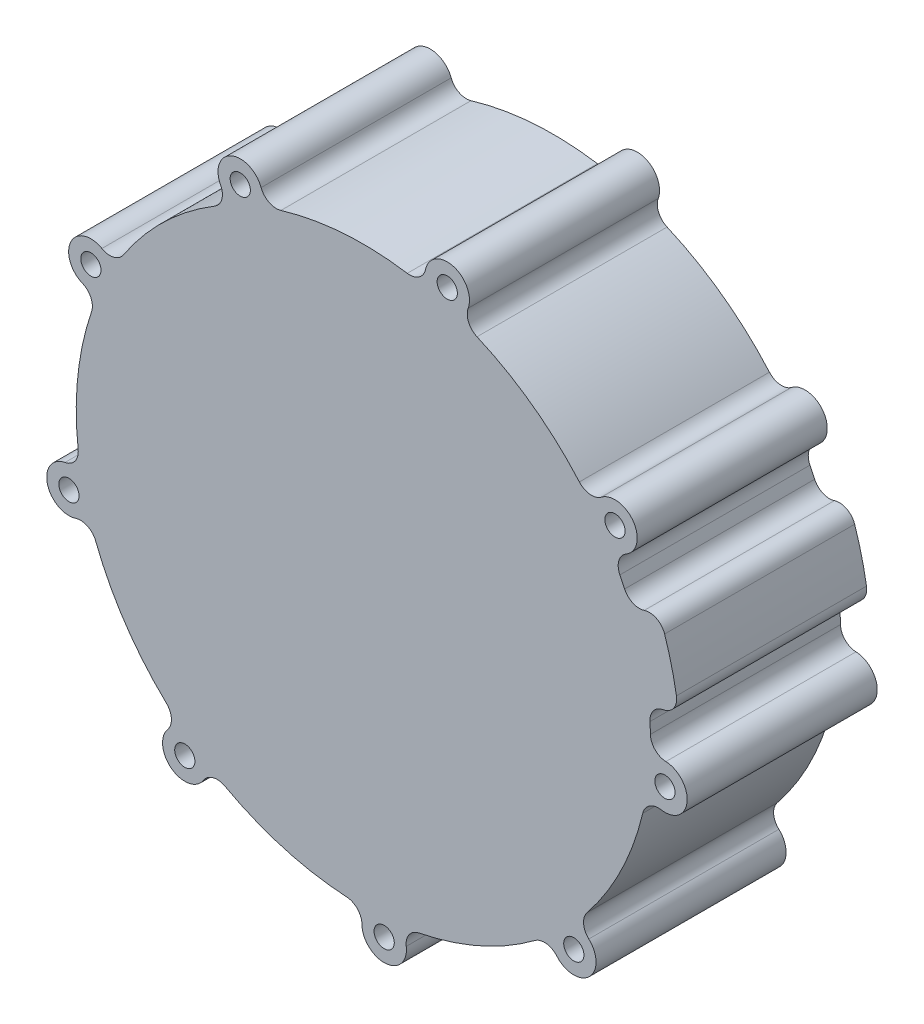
ISO-10303-21;
HEADER;
FILE_DESCRIPTION(('STEP AP214'),'2;1');
FILE_NAME('part.step','',(''),(''),'','','');
FILE_SCHEMA(('AUTOMOTIVE_DESIGN { 1 0 10303 214 1 1 1 1 }'));
ENDSEC;
DATA;
#1=APPLICATION_CONTEXT('core data for automotive mechanical design processes');
#2=APPLICATION_PROTOCOL_DEFINITION('international standard','automotive_design',2000,#1);
#3=PRODUCT_CONTEXT('',#1,'mechanical');
#4=PRODUCT('Part','Part','',(#3));
#5=PRODUCT_RELATED_PRODUCT_CATEGORY('part','',(#4));
#6=PRODUCT_DEFINITION_FORMATION('','',#4);
#7=PRODUCT_DEFINITION_CONTEXT('part definition',#1,'design');
#8=PRODUCT_DEFINITION('design','',#6,#7);
#9=PRODUCT_DEFINITION_SHAPE('','',#8);
#10=(LENGTH_UNIT() NAMED_UNIT(*) SI_UNIT(.MILLI.,.METRE.));
#11=(NAMED_UNIT(*) PLANE_ANGLE_UNIT() SI_UNIT($,.RADIAN.));
#12=(NAMED_UNIT(*) SI_UNIT($,.STERADIAN.) SOLID_ANGLE_UNIT());
#13=UNCERTAINTY_MEASURE_WITH_UNIT(LENGTH_MEASURE(1.E-05),#10,'distance_accuracy_value','');
#14=(GEOMETRIC_REPRESENTATION_CONTEXT(3) GLOBAL_UNCERTAINTY_ASSIGNED_CONTEXT((#13)) GLOBAL_UNIT_ASSIGNED_CONTEXT((#10,
#11,#12)) REPRESENTATION_CONTEXT('',''));
#15=CARTESIAN_POINT('',(0.,0.,0.));
#16=DIRECTION('',(0.,0.,1.));
#17=DIRECTION('',(1.,0.,0.));
#18=AXIS2_PLACEMENT_3D('',#15,#16,#17);
#19=CARTESIAN_POINT('',(0.,0.,-25.30001119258));
#20=DIRECTION('',(0.,0.,-1.));
#21=DIRECTION('',(0.,-1.,0.));
#22=AXIS2_PLACEMENT_3D('',#19,#20,#21);
#23=PLANE('',#22);
#24=CARTESIAN_POINT('',(82.22978825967,47.14918824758,-25.30001119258));
#25=DIRECTION('',(0.,0.,1.));
#26=DIRECTION('',(0.970991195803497,0.239115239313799,0.));
#27=AXIS2_PLACEMENT_3D('',#24,#25,#26);
#28=CIRCLE('',#27,1.710802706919);
#29=CARTESIAN_POINT('',(83.81143909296,47.80128221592,-25.30001119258));
#30=VERTEX_POINT('',#29);
#31=EDGE_CURVE('E11',#30,#30,#28,.T.);
#32=ORIENTED_EDGE('',*,*,#31,.F.);
#33=EDGE_LOOP('',(#32));
#34=FACE_BOUND('',#33,.T.);
#35=ADVANCED_FACE('F18',(#34),#23,.T.);
#36=CARTESIAN_POINT('',(82.22978825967,47.14918824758,-25.10001119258));
#37=DIRECTION('',(0.,0.,1.));
#38=DIRECTION('',(-0.924508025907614,-0.381162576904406,0.));
#39=AXIS2_PLACEMENT_3D('',#36,#37,#38);
#40=TOROIDAL_SURFACE('',#39,1.710802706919,0.2);
#41=CARTESIAN_POINT('',(82.22978825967,47.14918824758,-25.1111051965));
#42=DIRECTION('',(0.,0.,1.));
#43=DIRECTION('',(0.970554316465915,0.240882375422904,0.));
#44=AXIS2_PLACEMENT_3D('',#41,#42,#43);
#45=CIRCLE('',#44,1.91049477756);
#46=CARTESIAN_POINT('',(83.99605601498,47.87739736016,-25.1111051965));
#47=VERTEX_POINT('',#46);
#48=CARTESIAN_POINT('',(84.0840272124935,47.6093927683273,-25.1111051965));
#49=VERTEX_POINT('',#48);
#50=EDGE_CURVE('E606',#47,#49,#45,.T.);
#51=ORIENTED_EDGE('',*,*,#50,.F.);
#52=CARTESIAN_POINT('',(83.8114390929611,47.8012822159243,-25.10001119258));
#53=DIRECTION('',(-0.381162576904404,0.924508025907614,0.));
#54=DIRECTION('',(0.924508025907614,0.381162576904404,0.));
#55=AXIS2_PLACEMENT_3D('',#52,#53,#54);
#56=CIRCLE('',#55,0.2);
#57=EDGE_CURVE('E21',#47,#30,#56,.T.);
#58=ORIENTED_EDGE('',*,*,#57,.T.);
#59=ORIENTED_EDGE('',*,*,#31,.T.);
#60=ORIENTED_EDGE('',*,*,#57,.F.);
#61=CARTESIAN_POINT('',(82.22978825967,47.14918824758,-25.1111051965));
#62=DIRECTION('',(0.,0.,1.));
#63=DIRECTION('',(0.970554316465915,0.240882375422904,0.));
#64=AXIS2_PLACEMENT_3D('',#61,#62,#63);
#65=CIRCLE('',#64,1.91049477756);
#66=EDGE_CURVE('E603',#49,#47,#65,.T.);
#67=ORIENTED_EDGE('',*,*,#66,.F.);
#68=EDGE_LOOP('',(#51,#58,#59,#60,#67));
#69=FACE_BOUND('',#68,.T.);
#70=ADVANCED_FACE('F614',(#69),#40,.T.);
#71=CARTESIAN_POINT('',(82.22978825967,47.14918824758,-24.30555819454));
#72=DIRECTION('',(0.,0.,1.));
#73=DIRECTION('',(-0.970554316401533,-0.240882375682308,0.));
#74=AXIS2_PLACEMENT_3D('',#71,#72,#73);
#75=CONICAL_SURFACE('',#74,1.95524738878,0.0554985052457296);
#76=CARTESIAN_POINT('',(82.22978825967,47.14918824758,-23.50001119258));
#77=DIRECTION('',(0.,0.,-1.));
#78=DIRECTION('',(-0.970554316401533,-0.240882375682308,0.));
#79=AXIS2_PLACEMENT_3D('',#76,#77,#78);
#80=CIRCLE('',#79,2.);
#81=CARTESIAN_POINT('',(84.17089689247,47.63095299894,-23.50001119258));
#82=VERTEX_POINT('',#81);
#83=EDGE_CURVE('E618',#82,#82,#80,.T.);
#84=ORIENTED_EDGE('',*,*,#83,.T.);
#85=DIRECTION('',(-0.0538366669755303,-0.0133617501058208,-0.998460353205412));
#86=VECTOR('',#85,1.);
#87=CARTESIAN_POINT('',(84.1274620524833,47.620172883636,-24.30555819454));
#88=LINE('',#87,#86);
#89=EDGE_CURVE('E579',#82,#49,#88,.T.);
#90=ORIENTED_EDGE('',*,*,#89,.T.);
#91=ORIENTED_EDGE('',*,*,#66,.T.);
#92=ORIENTED_EDGE('',*,*,#50,.T.);
#93=ORIENTED_EDGE('',*,*,#89,.F.);
#94=EDGE_LOOP('',(#84,#90,#91,#92,#93));
#95=FACE_BOUND('',#94,.T.);
#96=ADVANCED_FACE('F616',(#95),#75,.T.);
#97=CARTESIAN_POINT('',(54.08371308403,40.16359935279,-18.00001119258));
#98=DIRECTION('',(0.,0.,1.));
#99=DIRECTION('',(1.,0.,0.));
#100=AXIS2_PLACEMENT_3D('',#97,#98,#99);
#101=PLANE('',#100);
#102=CARTESIAN_POINT('',(54.08371308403,40.16359935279,-18.00001119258));
#103=DIRECTION('',(0.,0.,1.));
#104=DIRECTION('',(1.,-1.029326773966E-13,0.));
#105=AXIS2_PLACEMENT_3D('',#102,#103,#104);
#106=CIRCLE('',#105,18.5);
#107=CARTESIAN_POINT('',(72.58371308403,40.16359935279,-18.00001119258));
#108=VERTEX_POINT('',#107);
#109=EDGE_CURVE('E580',#108,#108,#106,.T.);
#110=ORIENTED_EDGE('',*,*,#109,.F.);
#111=EDGE_LOOP('',(#110));
#112=FACE_BOUND('',#111,.T.);
#113=ADVANCED_FACE('F1332',(#112),#101,.F.);
#114=CARTESIAN_POINT('',(54.08371308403,40.16359935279,-6.700011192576));
#115=DIRECTION('',(0.,0.,-1.));
#116=DIRECTION('',(-1.,0.,0.));
#117=AXIS2_PLACEMENT_3D('',#114,#115,#116);
#118=CYLINDRICAL_SURFACE('',#117,18.5);
#119=ORIENTED_EDGE('',*,*,#109,.T.);
#120=DIRECTION('',(0.,0.,-1.));
#121=VECTOR('',#120,1.);
#122=CARTESIAN_POINT('',(72.58371308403,40.16359935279,-6.700011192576));
#123=LINE('',#122,#121);
#124=CARTESIAN_POINT('',(72.58371308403,40.16359935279,-22.00001119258));
#125=VERTEX_POINT('',#124);
#126=EDGE_CURVE('E576',#108,#125,#123,.T.);
#127=ORIENTED_EDGE('',*,*,#126,.T.);
#128=CARTESIAN_POINT('',(54.08371308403,40.16359935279,-22.00001119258));
#129=DIRECTION('',(0.,0.,-1.));
#130=DIRECTION('',(-1.,0.,0.));
#131=AXIS2_PLACEMENT_3D('',#128,#129,#130);
#132=CIRCLE('',#131,18.5);
#133=EDGE_CURVE('E593',#125,#125,#132,.T.);
#134=ORIENTED_EDGE('',*,*,#133,.T.);
#135=ORIENTED_EDGE('',*,*,#126,.F.);
#136=EDGE_LOOP('',(#119,#127,#134,#135));
#137=FACE_BOUND('',#136,.T.);
#138=ADVANCED_FACE('F1415',(#137),#118,.F.);
#139=CARTESIAN_POINT('',(54.08371308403,40.16359935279,-22.00001119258));
#140=DIRECTION('',(0.,0.,1.));
#141=DIRECTION('',(1.,0.,0.));
#142=AXIS2_PLACEMENT_3D('',#139,#140,#141);
#143=PLANE('',#142);
#144=ORIENTED_EDGE('',*,*,#133,.F.);
#145=EDGE_LOOP('',(#144));
#146=FACE_BOUND('',#145,.T.);
#147=CARTESIAN_POINT('',(54.08371308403,40.16359935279,-22.00001119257));
#148=DIRECTION('',(0.,0.,1.));
#149=DIRECTION('',(0.,-1.,0.));
#150=AXIS2_PLACEMENT_3D('',#147,#148,#149);
#151=CIRCLE('',#150,19.4);
#152=CARTESIAN_POINT('',(54.08371308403,59.56359935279,-22.00001119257));
#153=VERTEX_POINT('',#152);
#154=EDGE_CURVE('E590',#153,#153,#151,.T.);
#155=ORIENTED_EDGE('',*,*,#154,.F.);
#156=EDGE_LOOP('',(#155));
#157=FACE_BOUND('',#156,.T.);
#158=ADVANCED_FACE('F1413',(#146,#157),#143,.F.);
#159=CARTESIAN_POINT('',(54.08371308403,40.16359935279,-21.84105919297));
#160=DIRECTION('',(0.,0.,-1.));
#161=DIRECTION('',(0.,-1.,0.));
#162=AXIS2_PLACEMENT_3D('',#159,#160,#161);
#163=CYLINDRICAL_SURFACE('',#162,19.4);
#164=ORIENTED_EDGE('',*,*,#154,.T.);
#165=DIRECTION('',(0.,0.,-1.));
#166=VECTOR('',#165,1.);
#167=CARTESIAN_POINT('',(54.08371308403,59.56359935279,-21.84105919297));
#168=LINE('',#167,#166);
#169=CARTESIAN_POINT('',(54.08371308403,59.56359935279,-23.60001119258));
#170=VERTEX_POINT('',#169);
#171=EDGE_CURVE('E142',#153,#170,#168,.T.);
#172=ORIENTED_EDGE('',*,*,#171,.T.);
#173=CARTESIAN_POINT('',(54.08371308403,40.16359935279,-23.60001119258));
#174=DIRECTION('',(0.,0.,-1.));
#175=DIRECTION('',(0.,1.,0.));
#176=AXIS2_PLACEMENT_3D('',#173,#174,#175);
#177=CIRCLE('',#176,19.4);
#178=EDGE_CURVE('E587',#170,#170,#177,.T.);
#179=ORIENTED_EDGE('',*,*,#178,.T.);
#180=ORIENTED_EDGE('',*,*,#171,.F.);
#181=EDGE_LOOP('',(#164,#172,#179,#180));
#182=FACE_BOUND('',#181,.T.);
#183=ADVANCED_FACE('F1411',(#182),#163,.F.);
#184=CARTESIAN_POINT('',(54.08371308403,40.16359935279,-23.60001119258));
#185=DIRECTION('',(0.,0.,1.));
#186=DIRECTION('',(1.,0.,0.));
#187=AXIS2_PLACEMENT_3D('',#184,#185,#186);
#188=PLANE('',#187);
#189=CARTESIAN_POINT('',(54.08371308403,40.16359935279,-23.60001119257));
#190=DIRECTION('',(0.,0.,1.));
#191=DIRECTION('',(1.,0.,0.));
#192=AXIS2_PLACEMENT_3D('',#189,#190,#191);
#193=CIRCLE('',#192,18.5);
#194=CARTESIAN_POINT('',(72.58371308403,40.16359935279,-23.60001119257));
#195=VERTEX_POINT('',#194);
#196=EDGE_CURVE('E525',#195,#195,#193,.T.);
#197=ORIENTED_EDGE('',*,*,#196,.F.);
#198=EDGE_LOOP('',(#197));
#199=FACE_BOUND('',#198,.T.);
#200=ORIENTED_EDGE('',*,*,#178,.F.);
#201=EDGE_LOOP('',(#200));
#202=FACE_BOUND('',#201,.T.);
#203=ADVANCED_FACE('F1409',(#199,#202),#188,.T.);
#204=CARTESIAN_POINT('',(54.08371308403,40.16359935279,-23.44105919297));
#205=DIRECTION('',(0.,0.,-1.));
#206=DIRECTION('',(-1.,0.,0.));
#207=AXIS2_PLACEMENT_3D('',#204,#205,#206);
#208=CYLINDRICAL_SURFACE('',#207,18.5);
#209=ORIENTED_EDGE('',*,*,#196,.T.);
#210=DIRECTION('',(0.,0.,-1.));
#211=VECTOR('',#210,1.);
#212=CARTESIAN_POINT('',(72.58371308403,40.16359935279,-23.44105919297));
#213=LINE('',#212,#211);
#214=CARTESIAN_POINT('',(72.58371308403,40.16359935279,-24.63398578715));
#215=VERTEX_POINT('',#214);
#216=EDGE_CURVE('E155',#195,#215,#213,.T.);
#217=ORIENTED_EDGE('',*,*,#216,.T.);
#218=CARTESIAN_POINT('',(54.08371308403,40.16359935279,-24.63398578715));
#219=DIRECTION('',(0.,0.,-1.));
#220=DIRECTION('',(0.,1.,0.));
#221=AXIS2_PLACEMENT_3D('',#218,#219,#220);
#222=CIRCLE('',#221,18.49999999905);
#223=CARTESIAN_POINT('',(54.08371308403,58.6635993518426,-24.6339857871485));
#224=VERTEX_POINT('',#223);
#225=EDGE_CURVE('E534',#215,#224,#222,.T.);
#226=ORIENTED_EDGE('',*,*,#225,.T.);
#227=CARTESIAN_POINT('',(54.08371308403,40.16359935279,-24.63398578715));
#228=DIRECTION('',(0.,0.,-1.));
#229=DIRECTION('',(0.,1.,0.));
#230=AXIS2_PLACEMENT_3D('',#227,#228,#229);
#231=CIRCLE('',#230,18.49999999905);
#232=EDGE_CURVE('E522',#224,#215,#231,.T.);
#233=ORIENTED_EDGE('',*,*,#232,.T.);
#234=ORIENTED_EDGE('',*,*,#216,.F.);
#235=EDGE_LOOP('',(#209,#217,#226,#233,#234));
#236=FACE_BOUND('',#235,.T.);
#237=ADVANCED_FACE('F1406',(#236),#208,.F.);
#238=CARTESIAN_POINT('',(54.08371308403,40.16359935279,-25.06699848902));
#239=DIRECTION('',(0.,0.,-1.));
#240=DIRECTION('',(0.,-1.,0.));
#241=AXIS2_PLACEMENT_3D('',#238,#239,#240);
#242=CONICAL_SURFACE('',#241,18.74999999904,0.523598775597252);
#243=ORIENTED_EDGE('',*,*,#225,.F.);
#244=ORIENTED_EDGE('',*,*,#232,.F.);
#245=DIRECTION('',(0.,0.499999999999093,-0.866025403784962));
#246=VECTOR('',#245,1.);
#247=CARTESIAN_POINT('',(54.08371308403,58.91359935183,-25.06699848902));
#248=LINE('',#247,#246);
#249=CARTESIAN_POINT('',(54.08371308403,59.1635993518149,-25.5000111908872));
#250=VERTEX_POINT('',#249);
#251=EDGE_CURVE('E517',#224,#250,#248,.T.);
#252=ORIENTED_EDGE('',*,*,#251,.T.);
#253=CARTESIAN_POINT('',(54.08371308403,40.16359935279,-25.50001119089));
#254=DIRECTION('',(0.,0.,-1.));
#255=DIRECTION('',(1.,-6.947612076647E-11,0.));
#256=AXIS2_PLACEMENT_3D('',#253,#254,#255);
#257=CIRCLE('',#256,18.99999999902);
#258=EDGE_CURVE('E521',#250,#250,#257,.T.);
#259=ORIENTED_EDGE('',*,*,#258,.T.);
#260=ORIENTED_EDGE('',*,*,#251,.F.);
#261=EDGE_LOOP('',(#243,#244,#252,#259,#260));
#262=FACE_BOUND('',#261,.T.);
#263=ADVANCED_FACE('F519',(#262),#242,.F.);
#264=CARTESIAN_POINT('',(54.08371308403,40.1635993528,-25.50001119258));
#265=DIRECTION('',(0.,0.,1.));
#266=DIRECTION('',(1.,0.,0.));
#267=AXIS2_PLACEMENT_3D('',#264,#265,#266);
#268=PLANE('',#267);
#269=ORIENTED_EDGE('',*,*,#258,.F.);
#270=EDGE_LOOP('',(#269));
#271=FACE_BOUND('',#270,.T.);
#272=CARTESIAN_POINT('',(54.08371308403,40.16359935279,-25.50001119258));
#273=DIRECTION('',(0.,0.,1.));
#274=DIRECTION('',(1.,4.577217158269E-13,0.));
#275=AXIS2_PLACEMENT_3D('',#272,#273,#274);
#276=CIRCLE('',#275,21.5);
#277=CARTESIAN_POINT('',(32.58371308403,40.16359934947,-25.50001119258));
#278=VERTEX_POINT('',#277);
#279=EDGE_CURVE('E573',#278,#278,#276,.T.);
#280=ORIENTED_EDGE('',*,*,#279,.F.);
#281=EDGE_LOOP('',(#280));
#282=FACE_BOUND('',#281,.T.);
#283=ADVANCED_FACE('F1399',(#271,#282),#268,.F.);
#284=CARTESIAN_POINT('',(54.08371308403,40.16359935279,-25.65896319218));
#285=DIRECTION('',(0.,0.,1.));
#286=DIRECTION('',(1.,0.,0.));
#287=AXIS2_PLACEMENT_3D('',#284,#285,#286);
#288=CYLINDRICAL_SURFACE('',#287,21.5);
#289=CARTESIAN_POINT('',(54.08371308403,40.16359935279,-24.00001119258));
#290=DIRECTION('',(0.,0.,-1.));
#291=DIRECTION('',(0.999910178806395,0.0134027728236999,0.));
#292=AXIS2_PLACEMENT_3D('',#289,#290,#291);
#293=CIRCLE('',#292,21.5);
#294=CARTESIAN_POINT('',(32.58564423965,39.87543973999,-24.00001119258));
#295=VERTEX_POINT('',#294);
#296=CARTESIAN_POINT('',(32.58371308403,40.16359935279,-24.00001119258));
#297=VERTEX_POINT('',#296);
#298=EDGE_CURVE('E565',#295,#297,#293,.T.);
#299=ORIENTED_EDGE('',*,*,#298,.T.);
#300=DIRECTION('',(0.,0.,-1.));
#301=VECTOR('',#300,1.);
#302=CARTESIAN_POINT('',(32.58371308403,40.16359935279,-25.65896319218));
#303=LINE('',#302,#301);
#304=EDGE_CURVE('E569',#297,#278,#303,.T.);
#305=ORIENTED_EDGE('',*,*,#304,.T.);
#306=ORIENTED_EDGE('',*,*,#279,.T.);
#307=ORIENTED_EDGE('',*,*,#304,.F.);
#308=CARTESIAN_POINT('',(54.08371308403,40.16359935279,-24.00001119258));
#309=DIRECTION('',(0.,0.,-1.));
#310=DIRECTION('',(0.999910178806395,0.0134027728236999,0.));
#311=AXIS2_PLACEMENT_3D('',#308,#309,#310);
#312=CIRCLE('',#311,21.5);
#313=EDGE_CURVE('E561',#297,#295,#312,.T.);
#314=ORIENTED_EDGE('',*,*,#313,.T.);
#315=EDGE_LOOP('',(#299,#305,#306,#307,#314));
#316=FACE_BOUND('',#315,.T.);
#317=ADVANCED_FACE('F1395',(#316),#288,.T.);
#318=CARTESIAN_POINT('',(54.08371308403,40.16359935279,-24.00001119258));
#319=DIRECTION('',(0.,0.,1.));
#320=DIRECTION('',(0.999910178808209,0.0134027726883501,0.));
#321=AXIS2_PLACEMENT_3D('',#318,#319,#320);
#322=TOROIDAL_SURFACE('',#321,22.,0.5);
#323=CARTESIAN_POINT('',(54.08371308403,40.16359935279,-23.50001119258));
#324=DIRECTION('',(0.,0.,-1.));
#325=DIRECTION('',(1.,6.760329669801E-11,0.));
#326=AXIS2_PLACEMENT_3D('',#323,#324,#325);
#327=CIRCLE('',#326,22.);
#328=CARTESIAN_POINT('',(32.0856891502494,39.8687383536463,-23.50001119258));
#329=VERTEX_POINT('',#328);
#330=EDGE_CURVE('E622',#329,#329,#327,.T.);
#331=ORIENTED_EDGE('',*,*,#330,.T.);
#332=CARTESIAN_POINT('',(32.0856891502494,39.8687383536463,-24.00001119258));
#333=DIRECTION('',(-0.0134027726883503,0.999910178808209,0.));
#334=DIRECTION('',(-0.999910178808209,-0.0134027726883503,0.));
#335=AXIS2_PLACEMENT_3D('',#332,#333,#334);
#336=CIRCLE('',#335,0.5);
#337=EDGE_CURVE('E557',#329,#295,#336,.T.);
#338=ORIENTED_EDGE('',*,*,#337,.T.);
#339=ORIENTED_EDGE('',*,*,#313,.F.);
#340=ORIENTED_EDGE('',*,*,#298,.F.);
#341=ORIENTED_EDGE('',*,*,#337,.F.);
#342=EDGE_LOOP('',(#331,#338,#339,#340,#341));
#343=FACE_BOUND('',#342,.T.);
#344=ADVANCED_FACE('F1392',(#343),#322,.F.);
#345=CARTESIAN_POINT('',(64.45785691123,76.20006893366,0.4699888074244));
#346=DIRECTION('',(0.,0.,-1.));
#347=DIRECTION('',(0.642787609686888,-0.766044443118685,0.));
#348=AXIS2_PLACEMENT_3D('',#345,#346,#347);
#349=CYLINDRICAL_SURFACE('',#348,1.250000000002);
#350=CARTESIAN_POINT('',(64.45785691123,76.20006893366,-1.119257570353E-05));
#351=DIRECTION('',(0.,0.,1.));
#352=DIRECTION('',(0.642787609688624,-0.766044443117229,0.));
#353=AXIS2_PLACEMENT_3D('',#350,#351,#352);
#354=CIRCLE('',#353,1.250000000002);
#355=CARTESIAN_POINT('',(63.65437239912,77.15762448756,-1.119257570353E-05));
#356=VERTEX_POINT('',#355);
#357=EDGE_CURVE('E873',#356,#356,#354,.T.);
#358=ORIENTED_EDGE('',*,*,#357,.T.);
#359=DIRECTION('',(0.,0.,-1.));
#360=VECTOR('',#359,1.);
#361=CARTESIAN_POINT('',(63.6543723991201,77.1576244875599,0.4699888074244));
#362=LINE('',#361,#360);
#363=CARTESIAN_POINT('',(63.65437239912,77.15762448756,-23.50001119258));
#364=VERTEX_POINT('',#363);
#365=EDGE_CURVE('E554',#356,#364,#362,.T.);
#366=ORIENTED_EDGE('',*,*,#365,.T.);
#367=CARTESIAN_POINT('',(64.45785691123,76.20006893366,-23.50001119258));
#368=DIRECTION('',(0.,0.,-1.));
#369=DIRECTION('',(-0.642787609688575,0.76604444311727,0.));
#370=AXIS2_PLACEMENT_3D('',#367,#368,#369);
#371=CIRCLE('',#370,1.250000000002);
#372=EDGE_CURVE('E633',#364,#364,#371,.T.);
#373=ORIENTED_EDGE('',*,*,#372,.T.);
#374=ORIENTED_EDGE('',*,*,#365,.F.);
#375=EDGE_LOOP('',(#358,#366,#373,#374));
#376=FACE_BOUND('',#375,.T.);
#377=ADVANCED_FACE('F1390',(#376),#349,.F.);
#378=CARTESIAN_POINT('',(85.1945644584,61.10076551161,0.4699888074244));
#379=DIRECTION('',(0.,0.,-1.));
#380=DIRECTION('',(0.,-1.,0.));
#381=AXIS2_PLACEMENT_3D('',#378,#379,#380);
#382=CYLINDRICAL_SURFACE('',#381,1.25);
#383=CARTESIAN_POINT('',(85.1945644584,61.10076551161,-1.119257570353E-05));
#384=DIRECTION('',(0.,0.,1.));
#385=DIRECTION('',(0.,-1.,0.));
#386=AXIS2_PLACEMENT_3D('',#383,#384,#385);
#387=CIRCLE('',#386,1.25);
#388=CARTESIAN_POINT('',(85.1945644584,62.35076551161,-1.119257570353E-05));
#389=VERTEX_POINT('',#388);
#390=EDGE_CURVE('E869',#389,#389,#387,.T.);
#391=ORIENTED_EDGE('',*,*,#390,.T.);
#392=DIRECTION('',(0.,0.,-1.));
#393=VECTOR('',#392,1.);
#394=CARTESIAN_POINT('',(85.1945644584,62.35076551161,0.4699888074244));
#395=LINE('',#394,#393);
#396=CARTESIAN_POINT('',(85.1945644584,62.35076551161,-23.50001119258));
#397=VERTEX_POINT('',#396);
#398=EDGE_CURVE('E553',#389,#397,#395,.T.);
#399=ORIENTED_EDGE('',*,*,#398,.T.);
#400=CARTESIAN_POINT('',(85.1945644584,61.10076551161,-23.50001119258));
#401=DIRECTION('',(0.,0.,-1.));
#402=DIRECTION('',(0.,1.,0.));
#403=AXIS2_PLACEMENT_3D('',#400,#401,#402);
#404=CIRCLE('',#403,1.25);
#405=EDGE_CURVE('E686',#397,#397,#404,.T.);
#406=ORIENTED_EDGE('',*,*,#405,.T.);
#407=ORIENTED_EDGE('',*,*,#398,.F.);
#408=EDGE_LOOP('',(#391,#399,#406,#407));
#409=FACE_BOUND('',#408,.T.);
#410=ADVANCED_FACE('F1386',(#409),#382,.F.);
#411=CARTESIAN_POINT('',(91.3741588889,36.20472935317,0.4699888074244));
#412=DIRECTION('',(0.,0.,-1.));
#413=DIRECTION('',(-0.642787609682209,-0.766044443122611,0.));
#414=AXIS2_PLACEMENT_3D('',#411,#412,#413);
#415=CYLINDRICAL_SURFACE('',#414,1.249999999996);
#416=CARTESIAN_POINT('',(91.3741588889,36.20472935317,-1.119257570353E-05));
#417=DIRECTION('',(0.,0.,1.));
#418=DIRECTION('',(-0.64278760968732,-0.766044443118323,0.));
#419=AXIS2_PLACEMENT_3D('',#416,#417,#418);
#420=CIRCLE('',#419,1.249999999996);
#421=CARTESIAN_POINT('',(92.17764340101,37.16228490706,-1.119257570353E-05));
#422=VERTEX_POINT('',#421);
#423=EDGE_CURVE('E868',#422,#422,#420,.T.);
#424=ORIENTED_EDGE('',*,*,#423,.T.);
#425=DIRECTION('',(0.,0.,-1.));
#426=VECTOR('',#425,1.);
#427=CARTESIAN_POINT('',(92.1776434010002,37.1622849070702,0.4699888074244));
#428=LINE('',#427,#426);
#429=CARTESIAN_POINT('',(92.17764340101,37.16228490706,-23.50001119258));
#430=VERTEX_POINT('',#429);
#431=EDGE_CURVE('E550',#422,#430,#428,.T.);
#432=ORIENTED_EDGE('',*,*,#431,.T.);
#433=CARTESIAN_POINT('',(91.3741588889,36.20472935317,-23.50001119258));
#434=DIRECTION('',(0.,0.,-1.));
#435=DIRECTION('',(0.642787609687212,0.766044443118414,0.));
#436=AXIS2_PLACEMENT_3D('',#433,#434,#435);
#437=CIRCLE('',#436,1.249999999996);
#438=EDGE_CURVE('E676',#430,#430,#437,.T.);
#439=ORIENTED_EDGE('',*,*,#438,.T.);
#440=ORIENTED_EDGE('',*,*,#431,.F.);
#441=EDGE_LOOP('',(#424,#432,#439,#440));
#442=FACE_BOUND('',#441,.T.);
#443=ADVANCED_FACE('F1382',(#442),#415,.F.);
#444=CARTESIAN_POINT('',(80.10513929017,13.16109246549,0.4699888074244));
#445=DIRECTION('',(0.,0.,-1.));
#446=DIRECTION('',(-0.98480775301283,-0.173648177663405,0.));
#447=AXIS2_PLACEMENT_3D('',#444,#445,#446);
#448=CYLINDRICAL_SURFACE('',#447,1.250000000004);
#449=CARTESIAN_POINT('',(80.10513929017,13.16109246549,-1.119257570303E-05));
#450=DIRECTION('',(0.,0.,1.));
#451=DIRECTION('',(-0.98480775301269,-0.173648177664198,0.));
#452=AXIS2_PLACEMENT_3D('',#449,#450,#451);
#453=CIRCLE('',#452,1.250000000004);
#454=CARTESIAN_POINT('',(81.33614898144,13.37815268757,-1.119257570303E-05));
#455=VERTEX_POINT('',#454);
#456=EDGE_CURVE('E864',#455,#455,#453,.T.);
#457=ORIENTED_EDGE('',*,*,#456,.T.);
#458=DIRECTION('',(0.,0.,-1.));
#459=VECTOR('',#458,1.);
#460=CARTESIAN_POINT('',(81.33614898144,13.37815268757,0.4699888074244));
#461=LINE('',#460,#459);
#462=CARTESIAN_POINT('',(81.33614898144,13.37815268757,-23.50001119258));
#463=VERTEX_POINT('',#462);
#464=EDGE_CURVE('E547',#455,#463,#461,.T.);
#465=ORIENTED_EDGE('',*,*,#464,.T.);
#466=CARTESIAN_POINT('',(80.10513929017,13.16109246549,-23.50001119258));
#467=DIRECTION('',(0.,0.,-1.));
#468=DIRECTION('',(0.98480775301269,0.173648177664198,0.));
#469=AXIS2_PLACEMENT_3D('',#466,#467,#468);
#470=CIRCLE('',#469,1.250000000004);
#471=EDGE_CURVE('E672',#463,#463,#470,.T.);
#472=ORIENTED_EDGE('',*,*,#471,.T.);
#473=ORIENTED_EDGE('',*,*,#464,.F.);
#474=EDGE_LOOP('',(#457,#465,#472,#473));
#475=FACE_BOUND('',#474,.T.);
#476=ADVANCED_FACE('F1379',(#475),#448,.F.);
#477=CARTESIAN_POINT('',(56.66040517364,2.752228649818,0.4699888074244));
#478=DIRECTION('',(0.,0.,-1.));
#479=DIRECTION('',(-0.866025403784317,0.50000000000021,0.));
#480=AXIS2_PLACEMENT_3D('',#477,#478,#479);
#481=CYLINDRICAL_SURFACE('',#480,1.25);
#482=CARTESIAN_POINT('',(56.66040517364,2.752228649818,-1.119257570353E-05));
#483=DIRECTION('',(0.,0.,1.));
#484=DIRECTION('',(-0.866025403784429,0.500000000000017,0.));
#485=AXIS2_PLACEMENT_3D('',#482,#483,#484);
#486=CIRCLE('',#485,1.25);
#487=CARTESIAN_POINT('',(57.74293692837,2.127228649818,-1.119257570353E-05));
#488=VERTEX_POINT('',#487);
#489=EDGE_CURVE('E860',#488,#488,#486,.T.);
#490=ORIENTED_EDGE('',*,*,#489,.T.);
#491=DIRECTION('',(0.,0.,-1.));
#492=VECTOR('',#491,1.);
#493=CARTESIAN_POINT('',(57.7429369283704,2.12722864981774,0.4699888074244));
#494=LINE('',#493,#492);
#495=CARTESIAN_POINT('',(57.74293692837,2.127228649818,-23.50001119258));
#496=VERTEX_POINT('',#495);
#497=EDGE_CURVE('E544',#488,#496,#494,.T.);
#498=ORIENTED_EDGE('',*,*,#497,.T.);
#499=CARTESIAN_POINT('',(56.66040517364,2.752228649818,-23.50001119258));
#500=DIRECTION('',(0.,0.,-1.));
#501=DIRECTION('',(0.866025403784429,-0.500000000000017,0.));
#502=AXIS2_PLACEMENT_3D('',#499,#500,#501);
#503=CIRCLE('',#502,1.25);
#504=EDGE_CURVE('E668',#496,#496,#503,.T.);
#505=ORIENTED_EDGE('',*,*,#504,.T.);
#506=ORIENTED_EDGE('',*,*,#497,.F.);
#507=EDGE_LOOP('',(#490,#498,#505,#506));
#508=FACE_BOUND('',#507,.T.);
#509=ADVANCED_FACE('F1377',(#508),#481,.F.);
#510=CARTESIAN_POINT('',(32.01000819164,9.848560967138,0.4699888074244));
#511=DIRECTION('',(0.,0.,-1.));
#512=DIRECTION('',(-0.342020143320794,0.939692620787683,0.));
#513=AXIS2_PLACEMENT_3D('',#510,#511,#512);
#514=CYLINDRICAL_SURFACE('',#513,1.249999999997);
#515=CARTESIAN_POINT('',(32.01000819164,9.848560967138,-1.119257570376E-05));
#516=DIRECTION('',(0.,0.,1.));
#517=DIRECTION('',(-0.342020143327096,0.939692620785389,0.));
#518=AXIS2_PLACEMENT_3D('',#515,#516,#517);
#519=CIRCLE('',#518,1.249999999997);
#520=CARTESIAN_POINT('',(32.4375333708,8.673945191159,-1.119257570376E-05));
#521=VERTEX_POINT('',#520);
#522=EDGE_CURVE('E859',#521,#521,#519,.T.);
#523=ORIENTED_EDGE('',*,*,#522,.T.);
#524=DIRECTION('',(0.,0.,-1.));
#525=VECTOR('',#524,1.);
#526=CARTESIAN_POINT('',(32.43753337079,8.67394519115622,0.4699888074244));
#527=LINE('',#526,#525);
#528=CARTESIAN_POINT('',(32.4375333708,8.673945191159,-23.50001119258));
#529=VERTEX_POINT('',#528);
#530=EDGE_CURVE('E543',#521,#529,#527,.T.);
#531=ORIENTED_EDGE('',*,*,#530,.T.);
#532=CARTESIAN_POINT('',(32.01000819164,9.848560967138,-23.50001119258));
#533=DIRECTION('',(0.,0.,-1.));
#534=DIRECTION('',(0.342020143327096,-0.939692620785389,0.));
#535=AXIS2_PLACEMENT_3D('',#532,#533,#534);
#536=CIRCLE('',#535,1.249999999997);
#537=EDGE_CURVE('E660',#529,#529,#536,.T.);
#538=ORIENTED_EDGE('',*,*,#537,.T.);
#539=ORIENTED_EDGE('',*,*,#530,.F.);
#540=EDGE_LOOP('',(#523,#531,#538,#539));
#541=FACE_BOUND('',#540,.T.);
#542=ADVANCED_FACE('F1373',(#541),#514,.F.);
#543=CARTESIAN_POINT('',(17.6881430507,31.12963665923,0.4699888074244));
#544=DIRECTION('',(0.,0.,-1.));
#545=DIRECTION('',(0.342020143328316,0.939692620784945,0.));
#546=AXIS2_PLACEMENT_3D('',#543,#544,#545);
#547=CYLINDRICAL_SURFACE('',#546,1.249999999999);
#548=CARTESIAN_POINT('',(17.6881430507,31.12963665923,-1.119257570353E-05));
#549=DIRECTION('',(0.,0.,1.));
#550=DIRECTION('',(0.342020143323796,0.93969262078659,0.));
#551=AXIS2_PLACEMENT_3D('',#548,#549,#550);
#552=CIRCLE('',#551,1.249999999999);
#553=CARTESIAN_POINT('',(17.26061787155,29.95502088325,-1.119257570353E-05));
#554=VERTEX_POINT('',#553);
#555=EDGE_CURVE('E666',#554,#554,#552,.T.);
#556=ORIENTED_EDGE('',*,*,#555,.T.);
#557=DIRECTION('',(0.,0.,-1.));
#558=VECTOR('',#557,1.);
#559=CARTESIAN_POINT('',(17.2606178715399,29.9550208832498,0.4699888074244));
#560=LINE('',#559,#558);
#561=CARTESIAN_POINT('',(17.26061787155,29.95502088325,-23.50001119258));
#562=VERTEX_POINT('',#561);
#563=EDGE_CURVE('E540',#554,#562,#560,.T.);
#564=ORIENTED_EDGE('',*,*,#563,.T.);
#565=CARTESIAN_POINT('',(17.6881430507,31.12963665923,-23.50001119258));
#566=DIRECTION('',(0.,0.,-1.));
#567=DIRECTION('',(-0.342020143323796,-0.93969262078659,0.));
#568=AXIS2_PLACEMENT_3D('',#565,#566,#567);
#569=CIRCLE('',#568,1.249999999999);
#570=EDGE_CURVE('E656',#562,#562,#569,.T.);
#571=ORIENTED_EDGE('',*,*,#570,.T.);
#572=ORIENTED_EDGE('',*,*,#563,.F.);
#573=EDGE_LOOP('',(#556,#564,#571,#572));
#574=FACE_BOUND('',#573,.T.);
#575=ADVANCED_FACE('F1370',(#574),#547,.F.);
#576=CARTESIAN_POINT('',(20.39616962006,56.63780389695,0.4699888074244));
#577=DIRECTION('',(0.,0.,-1.));
#578=DIRECTION('',(0.866025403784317,0.50000000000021,0.));
#579=AXIS2_PLACEMENT_3D('',#576,#577,#578);
#580=CYLINDRICAL_SURFACE('',#579,1.25);
#581=CARTESIAN_POINT('',(20.39616962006,56.63780389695,-1.119257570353E-05));
#582=DIRECTION('',(0.,0.,1.));
#583=DIRECTION('',(0.866025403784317,0.50000000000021,0.));
#584=AXIS2_PLACEMENT_3D('',#581,#582,#583);
#585=CIRCLE('',#584,1.25);
#586=CARTESIAN_POINT('',(19.31363786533,56.01280389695,-1.119257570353E-05));
#587=VERTEX_POINT('',#586);
#588=EDGE_CURVE('E662',#587,#587,#585,.T.);
#589=ORIENTED_EDGE('',*,*,#588,.T.);
#590=DIRECTION('',(0.,0.,-1.));
#591=VECTOR('',#590,1.);
#592=CARTESIAN_POINT('',(19.3136378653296,56.0128038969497,0.4699888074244));
#593=LINE('',#592,#591);
#594=CARTESIAN_POINT('',(19.31363786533,56.01280389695,-23.50001119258));
#595=VERTEX_POINT('',#594);
#596=EDGE_CURVE('E538',#587,#595,#593,.T.);
#597=ORIENTED_EDGE('',*,*,#596,.T.);
#598=CARTESIAN_POINT('',(20.39616962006,56.63780389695,-23.50001119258));
#599=DIRECTION('',(0.,0.,-1.));
#600=DIRECTION('',(-0.866025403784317,-0.50000000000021,0.));
#601=AXIS2_PLACEMENT_3D('',#598,#599,#600);
#602=CIRCLE('',#601,1.25);
#603=EDGE_CURVE('E661',#595,#595,#602,.T.);
#604=ORIENTED_EDGE('',*,*,#603,.T.);
#605=ORIENTED_EDGE('',*,*,#596,.F.);
#606=EDGE_LOOP('',(#589,#597,#604,#605));
#607=FACE_BOUND('',#606,.T.);
#608=ADVANCED_FACE('F949',(#607),#580,.F.);
#609=CARTESIAN_POINT('',(38.86697217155,74.43750773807,0.4699888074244));
#610=DIRECTION('',(0.,0.,-1.));
#611=DIRECTION('',(0.98480775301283,-0.173648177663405,0.));
#612=AXIS2_PLACEMENT_3D('',#609,#610,#611);
#613=CYLINDRICAL_SURFACE('',#612,1.250000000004);
#614=CARTESIAN_POINT('',(38.86697217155,74.43750773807,-1.119257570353E-05));
#615=DIRECTION('',(0.,0.,1.));
#616=DIRECTION('',(0.984807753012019,-0.173648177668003,0.));
#617=AXIS2_PLACEMENT_3D('',#614,#615,#616);
#618=CIRCLE('',#617,1.250000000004);
#619=CARTESIAN_POINT('',(37.63596248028,74.65456796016,-1.119257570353E-05));
#620=VERTEX_POINT('',#619);
#621=EDGE_CURVE('E667',#620,#620,#618,.T.);
#622=ORIENTED_EDGE('',*,*,#621,.T.);
#623=DIRECTION('',(0.,0.,-1.));
#624=VECTOR('',#623,1.);
#625=CARTESIAN_POINT('',(37.63596248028,74.65456796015,0.4699888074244));
#626=LINE('',#625,#624);
#627=CARTESIAN_POINT('',(37.63596248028,74.65456796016,-23.50001119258));
#628=VERTEX_POINT('',#627);
#629=EDGE_CURVE('E937',#620,#628,#626,.T.);
#630=ORIENTED_EDGE('',*,*,#629,.T.);
#631=CARTESIAN_POINT('',(38.86697217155,74.43750773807,-23.50001119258));
#632=DIRECTION('',(0.,0.,-1.));
#633=DIRECTION('',(-0.984807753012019,0.173648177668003,0.));
#634=AXIS2_PLACEMENT_3D('',#631,#632,#633);
#635=CIRCLE('',#634,1.250000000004);
#636=EDGE_CURVE('E643',#628,#628,#635,.T.);
#637=ORIENTED_EDGE('',*,*,#636,.T.);
#638=ORIENTED_EDGE('',*,*,#629,.F.);
#639=EDGE_LOOP('',(#622,#630,#637,#638));
#640=FACE_BOUND('',#639,.T.);
#641=ADVANCED_FACE('F1366',(#640),#613,.F.);
#642=CARTESIAN_POINT('',(82.29826940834,64.86559950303,0.4699888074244));
#643=DIRECTION('',(0.,0.,-1.));
#644=DIRECTION('',(0.,-1.,0.));
#645=AXIS2_PLACEMENT_3D('',#642,#643,#644);
#646=CYLINDRICAL_SURFACE('',#645,2.);
#647=DIRECTION('',(1.077001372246E-12,-1.114796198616E-12,-1.));
#648=VECTOR('',#647,1.);
#649=CARTESIAN_POINT('',(80.79349307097,63.54815949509,-1.119257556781E-05));
#650=LINE('',#649,#648);
#651=CARTESIAN_POINT('',(80.79349307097,63.54815949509,-1.119257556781E-05));
#652=VERTEX_POINT('',#651);
#653=CARTESIAN_POINT('',(80.79349307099,63.54815949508,-23.50001119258));
#654=VERTEX_POINT('',#653);
#655=EDGE_CURVE('E705',#652,#654,#650,.T.);
#656=ORIENTED_EDGE('',*,*,#655,.F.);
#657=CARTESIAN_POINT('',(82.29826940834,64.86559950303,-1.119257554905E-05));
#658=DIRECTION('',(0.,0.,1.));
#659=DIRECTION('',(0.,-1.,0.));
#660=AXIS2_PLACEMENT_3D('',#657,#658,#659);
#661=CIRCLE('',#660,2.);
#662=CARTESIAN_POINT('',(83.51776206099,63.28040624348,-1.119257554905E-05));
#663=VERTEX_POINT('',#662);
#664=EDGE_CURVE('E834',#652,#663,#661,.T.);
#665=ORIENTED_EDGE('',*,*,#664,.T.);
#666=DIRECTION('',(0.,0.,1.));
#667=VECTOR('',#666,1.);
#668=CARTESIAN_POINT('',(83.51776206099,63.28040624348,-23.50001119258));
#669=LINE('',#668,#667);
#670=CARTESIAN_POINT('',(83.51776206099,63.28040624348,-23.50001119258));
#671=VERTEX_POINT('',#670);
#672=EDGE_CURVE('E935',#671,#663,#669,.T.);
#673=ORIENTED_EDGE('',*,*,#672,.F.);
#674=CARTESIAN_POINT('',(82.29826940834,64.86559950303,-23.50001119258));
#675=DIRECTION('',(0.,0.,-1.));
#676=DIRECTION('',(0.,-1.,0.));
#677=AXIS2_PLACEMENT_3D('',#674,#675,#676);
#678=CIRCLE('',#677,2.);
#679=EDGE_CURVE('E1242',#671,#654,#678,.T.);
#680=ORIENTED_EDGE('',*,*,#679,.T.);
#681=EDGE_LOOP('',(#656,#665,#673,#680));
#682=FACE_BOUND('',#681,.T.);
#683=ADVANCED_FACE('F1363',(#682),#646,.F.);
#684=CARTESIAN_POINT('',(85.1945644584,61.10076551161,0.4699888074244));
#685=DIRECTION('',(0.,0.,-1.));
#686=DIRECTION('',(0.829622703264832,0.558324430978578,0.));
#687=AXIS2_PLACEMENT_3D('',#684,#685,#686);
#688=CYLINDRICAL_SURFACE('',#687,2.75);
#689=CARTESIAN_POINT('',(85.1945644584,61.10076551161,-23.50001119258));
#690=DIRECTION('',(0.,0.,1.));
#691=DIRECTION('',(0.,1.,0.));
#692=AXIS2_PLACEMENT_3D('',#689,#690,#691);
#693=CIRCLE('',#692,2.75);
#694=CARTESIAN_POINT('',(86.58238161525,58.72664177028,-23.50001119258));
#695=VERTEX_POINT('',#694);
#696=EDGE_CURVE('E1246',#695,#671,#693,.T.);
#697=ORIENTED_EDGE('',*,*,#696,.T.);
#698=ORIENTED_EDGE('',*,*,#672,.T.);
#699=CARTESIAN_POINT('',(85.1945644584,61.10076551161,-1.119257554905E-05));
#700=DIRECTION('',(0.,0.,-1.));
#701=DIRECTION('',(0.609746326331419,-0.792596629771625,0.));
#702=AXIS2_PLACEMENT_3D('',#699,#700,#701);
#703=CIRCLE('',#702,2.75);
#704=CARTESIAN_POINT('',(86.58238161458,58.72664176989,-1.119257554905E-05));
#705=VERTEX_POINT('',#704);
#706=EDGE_CURVE('E830',#663,#705,#703,.T.);
#707=ORIENTED_EDGE('',*,*,#706,.T.);
#708=DIRECTION('',(9.37855939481E-12,5.896597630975E-12,-1.));
#709=VECTOR('',#708,1.);
#710=CARTESIAN_POINT('',(86.5823816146,58.7266417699,-1.119257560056E-05));
#711=LINE('',#710,#709);
#712=EDGE_CURVE('E934',#705,#695,#711,.T.);
#713=ORIENTED_EDGE('',*,*,#712,.T.);
#714=EDGE_LOOP('',(#697,#698,#707,#713));
#715=FACE_BOUND('',#714,.T.);
#716=ADVANCED_FACE('F1361',(#715),#688,.T.);
#717=CARTESIAN_POINT('',(87.59170318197,57.00000632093,0.4699888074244));
#718=DIRECTION('',(0.,0.,-1.));
#719=DIRECTION('',(0.,-1.,0.));
#720=AXIS2_PLACEMENT_3D('',#717,#718,#719);
#721=CYLINDRICAL_SURFACE('',#720,2.);
#722=DIRECTION('',(0.,0.,1.));
#723=VECTOR('',#722,1.);
#724=CARTESIAN_POINT('',(85.80461037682,56.10206461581,-23.50001119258));
#725=LINE('',#724,#723);
#726=CARTESIAN_POINT('',(85.80461037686,56.10206461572,-23.50001119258));
#727=VERTEX_POINT('',#726);
#728=CARTESIAN_POINT('',(85.80461037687,56.10206461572,-1.119257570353E-05));
#729=VERTEX_POINT('',#728);
#730=EDGE_CURVE('E931',#727,#729,#725,.T.);
#731=ORIENTED_EDGE('',*,*,#730,.F.);
#732=CARTESIAN_POINT('',(87.59170318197,57.00000632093,-23.50001119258));
#733=DIRECTION('',(0.,0.,-1.));
#734=DIRECTION('',(-0.893546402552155,-0.448970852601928,0.));
#735=AXIS2_PLACEMENT_3D('',#732,#733,#734);
#736=CIRCLE('',#735,2.);
#737=EDGE_CURVE('E1254',#727,#695,#736,.T.);
#738=ORIENTED_EDGE('',*,*,#737,.T.);
#739=ORIENTED_EDGE('',*,*,#712,.F.);
#740=CARTESIAN_POINT('',(87.59170318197,57.00000632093,-1.119257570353E-05));
#741=DIRECTION('',(0.,0.,1.));
#742=DIRECTION('',(-0.5046607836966,0.863317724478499,0.));
#743=AXIS2_PLACEMENT_3D('',#740,#741,#742);
#744=CIRCLE('',#743,2.);
#745=EDGE_CURVE('E745',#705,#729,#744,.T.);
#746=ORIENTED_EDGE('',*,*,#745,.T.);
#747=EDGE_LOOP('',(#731,#738,#739,#746));
#748=FACE_BOUND('',#747,.T.);
#749=ADVANCED_FACE('F1357',(#748),#721,.F.);
#750=CARTESIAN_POINT('',(54.08371308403,40.16359935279,0.4699888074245));
#751=DIRECTION('',(0.,0.,-1.));
#752=DIRECTION('',(-1.,0.,0.));
#753=AXIS2_PLACEMENT_3D('',#750,#751,#752);
#754=CYLINDRICAL_SURFACE('',#753,35.5);
#755=ORIENTED_EDGE('',*,*,#730,.T.);
#756=CARTESIAN_POINT('',(54.08371308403,40.16359935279,-1.119257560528E-05));
#757=DIRECTION('',(0.,0.,-1.));
#758=DIRECTION('',(0.893546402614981,0.448970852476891,0.));
#759=AXIS2_PLACEMENT_3D('',#756,#757,#758);
#760=CIRCLE('',#759,35.5);
#761=CARTESIAN_POINT('',(86.38837233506,54.88294005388,-1.119257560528E-05));
#762=VERTEX_POINT('',#761);
#763=EDGE_CURVE('E741',#729,#762,#760,.T.);
#764=ORIENTED_EDGE('',*,*,#763,.T.);
#765=DIRECTION('',(0.,0.,-1.));
#766=VECTOR('',#765,1.);
#767=CARTESIAN_POINT('',(86.38837233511,54.88294005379,-1.119257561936E-05));
#768=LINE('',#767,#766);
#769=CARTESIAN_POINT('',(86.38837233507,54.88294005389,-23.50001119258));
#770=VERTEX_POINT('',#769);
#771=EDGE_CURVE('E928',#762,#770,#768,.T.);
#772=ORIENTED_EDGE('',*,*,#771,.T.);
#773=CARTESIAN_POINT('',(54.08371308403,40.16359935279,-23.50001119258));
#774=DIRECTION('',(0.,0.,1.));
#775=DIRECTION('',(0.909990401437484,0.414629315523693,0.));
#776=AXIS2_PLACEMENT_3D('',#773,#774,#775);
#777=CIRCLE('',#776,35.5);
#778=EDGE_CURVE('E1249',#770,#727,#777,.T.);
#779=ORIENTED_EDGE('',*,*,#778,.T.);
#780=EDGE_LOOP('',(#755,#764,#772,#779));
#781=FACE_BOUND('',#780,.T.);
#782=ADVANCED_FACE('F1353',(#781),#754,.T.);
#783=CARTESIAN_POINT('',(88.20835313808,55.71219868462,0.4699888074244));
#784=DIRECTION('',(0.,0.,-1.));
#785=DIRECTION('',(0.30663073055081,-0.951828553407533,0.));
#786=AXIS2_PLACEMENT_3D('',#783,#784,#785);
#787=CYLINDRICAL_SURFACE('',#786,1.999999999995);
#788=ORIENTED_EDGE('',*,*,#771,.F.);
#789=CARTESIAN_POINT('',(88.20835313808,55.71219868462,-1.119257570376E-05));
#790=DIRECTION('',(0.,0.,1.));
#791=DIRECTION('',(-0.909990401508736,-0.414629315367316,0.));
#792=AXIS2_PLACEMENT_3D('',#789,#790,#791);
#793=CIRCLE('',#792,1.999999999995);
#794=CARTESIAN_POINT('',(88.82161459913,53.80854157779,-1.119257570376E-05));
#795=VERTEX_POINT('',#794);
#796=EDGE_CURVE('E649',#762,#795,#793,.T.);
#797=ORIENTED_EDGE('',*,*,#796,.T.);
#798=DIRECTION('',(1.946584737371E-12,7.132639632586E-13,1.));
#799=VECTOR('',#798,1.);
#800=CARTESIAN_POINT('',(88.82161459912,53.80854157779,-23.50001119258));
#801=LINE('',#800,#799);
#802=CARTESIAN_POINT('',(88.82161459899,53.80854157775,-23.50001119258));
#803=VERTEX_POINT('',#802);
#804=EDGE_CURVE('E925',#803,#795,#801,.T.);
#805=ORIENTED_EDGE('',*,*,#804,.F.);
#806=CARTESIAN_POINT('',(88.20835313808,55.71219868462,-23.50001119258));
#807=DIRECTION('',(0.,0.,-1.));
#808=DIRECTION('',(0.306630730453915,-0.951828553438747,0.));
#809=AXIS2_PLACEMENT_3D('',#806,#807,#808);
#810=CIRCLE('',#809,1.999999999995);
#811=EDGE_CURVE('E1253',#803,#770,#810,.T.);
#812=ORIENTED_EDGE('',*,*,#811,.T.);
#813=EDGE_LOOP('',(#788,#797,#805,#812));
#814=FACE_BOUND('',#813,.T.);
#815=ADVANCED_FACE('F1349',(#814),#787,.F.);
#816=CARTESIAN_POINT('',(89.43487606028,51.90488447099,0.4699888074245));
#817=DIRECTION('',(0.,0.,-1.));
#818=DIRECTION('',(-0.306630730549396,0.951828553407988,0.));
#819=AXIS2_PLACEMENT_3D('',#816,#817,#818);
#820=CYLINDRICAL_SURFACE('',#819,2.000000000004);
#821=ORIENTED_EDGE('',*,*,#804,.T.);
#822=CARTESIAN_POINT('',(89.43487606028,51.90488447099,-1.119257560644E-05));
#823=DIRECTION('',(0.,0.,-1.));
#824=DIRECTION('',(-0.306630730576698,0.951828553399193,0.));
#825=AXIS2_PLACEMENT_3D('',#822,#823,#824);
#826=CIRCLE('',#825,2.000000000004);
#827=CARTESIAN_POINT('',(91.33292507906,52.53528904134,-1.119257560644E-05));
#828=VERTEX_POINT('',#827);
#829=EDGE_CURVE('E645',#795,#828,#826,.T.);
#830=ORIENTED_EDGE('',*,*,#829,.T.);
#831=DIRECTION('',(0.,0.,1.));
#832=VECTOR('',#831,1.);
#833=CARTESIAN_POINT('',(91.33292507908,52.53528904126,-23.50001119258));
#834=LINE('',#833,#832);
#835=CARTESIAN_POINT('',(91.33292507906,52.53528904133,-23.50001119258));
#836=VERTEX_POINT('',#835);
#837=EDGE_CURVE('E922',#836,#828,#834,.T.);
#838=ORIENTED_EDGE('',*,*,#837,.F.);
#839=CARTESIAN_POINT('',(89.43487606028,51.90488447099,-23.50001119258));
#840=DIRECTION('',(0.,0.,1.));
#841=DIRECTION('',(0.949024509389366,0.315202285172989,0.));
#842=AXIS2_PLACEMENT_3D('',#839,#840,#841);
#843=CIRCLE('',#842,2.000000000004);
#844=EDGE_CURVE('E1216',#836,#803,#843,.T.);
#845=ORIENTED_EDGE('',*,*,#844,.T.);
#846=EDGE_LOOP('',(#821,#830,#838,#845));
#847=FACE_BOUND('',#846,.T.);
#848=ADVANCED_FACE('F1345',(#847),#820,.T.);
#849=CARTESIAN_POINT('',(54.08371308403,40.16359935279,-23.97001119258));
#850=DIRECTION('',(0.,0.,1.));
#851=DIRECTION('',(0.923879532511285,0.382683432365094,0.));
#852=AXIS2_PLACEMENT_3D('',#849,#850,#851);
#853=CYLINDRICAL_SURFACE('',#852,39.25);
#854=DIRECTION('',(0.,1.750656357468E-13,1.));
#855=VECTOR('',#854,1.);
#856=CARTESIAN_POINT('',(92.79494531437,46.64457144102,-23.50001119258));
#857=LINE('',#856,#855);
#858=CARTESIAN_POINT('',(92.79494531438,46.64457144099,-23.50001119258));
#859=VERTEX_POINT('',#858);
#860=CARTESIAN_POINT('',(92.79494531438,46.64457144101,-1.119257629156E-05));
#861=VERTEX_POINT('',#860);
#862=EDGE_CURVE('E919',#859,#861,#857,.T.);
#863=ORIENTED_EDGE('',*,*,#862,.F.);
#864=CARTESIAN_POINT('',(54.08371308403,40.16359935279,-23.50001119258));
#865=DIRECTION('',(0.,0.,1.));
#866=DIRECTION('',(0.98627343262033,0.165120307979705,0.));
#867=AXIS2_PLACEMENT_3D('',#864,#865,#866);
#868=CIRCLE('',#867,39.25);
#869=EDGE_CURVE('E1193',#859,#836,#868,.T.);
#870=ORIENTED_EDGE('',*,*,#869,.T.);
#871=ORIENTED_EDGE('',*,*,#837,.T.);
#872=CARTESIAN_POINT('',(54.08371308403,40.16359935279,-1.119257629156E-05));
#873=DIRECTION('',(0.,0.,-1.));
#874=DIRECTION('',(0.949024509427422,0.315202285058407,0.));
#875=AXIS2_PLACEMENT_3D('',#872,#873,#874);
#876=CIRCLE('',#875,39.25);
#877=EDGE_CURVE('E650',#828,#861,#876,.T.);
#878=ORIENTED_EDGE('',*,*,#877,.T.);
#879=EDGE_LOOP('',(#863,#870,#871,#878));
#880=FACE_BOUND('',#879,.T.);
#881=ADVANCED_FACE('F1341',(#880),#853,.T.);
#882=CARTESIAN_POINT('',(90.82239844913,46.31433082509,0.4699888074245));
#883=DIRECTION('',(0.,0.,-1.));
#884=DIRECTION('',(0.98627343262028,0.165120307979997,0.));
#885=AXIS2_PLACEMENT_3D('',#882,#883,#884);
#886=CYLINDRICAL_SURFACE('',#885,1.999999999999);
#887=DIRECTION('',(1.019553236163E-12,2.697038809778E-13,-1.));
#888=VECTOR('',#887,1.);
#889=CARTESIAN_POINT('',(91.17041496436,44.34484243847,-1.119257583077E-05));
#890=LINE('',#889,#888);
#891=CARTESIAN_POINT('',(91.1704149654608,44.3448424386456,-1.11925758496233E-05));
#892=VERTEX_POINT('',#891);
#893=CARTESIAN_POINT('',(91.170414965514,44.3448424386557,-23.50001119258));
#894=VERTEX_POINT('',#893);
#895=EDGE_CURVE('E916',#892,#894,#890,.T.);
#896=ORIENTED_EDGE('',*,*,#895,.T.);
#897=CARTESIAN_POINT('',(90.82239844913,46.31433082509,-23.50001119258));
#898=DIRECTION('',(0.,0.,1.));
#899=DIRECTION('',(0.174008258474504,-0.984744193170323,0.));
#900=AXIS2_PLACEMENT_3D('',#897,#898,#899);
#901=CIRCLE('',#900,1.999999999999);
#902=EDGE_CURVE('E1189',#894,#859,#901,.T.);
#903=ORIENTED_EDGE('',*,*,#902,.T.);
#904=ORIENTED_EDGE('',*,*,#862,.T.);
#905=CARTESIAN_POINT('',(90.82239844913,46.31433082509,-1.119257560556E-05));
#906=DIRECTION('',(0.,0.,-1.));
#907=DIRECTION('',(0.986273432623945,0.165120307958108,0.));
#908=AXIS2_PLACEMENT_3D('',#905,#906,#907);
#909=CIRCLE('',#908,1.999999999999);
#910=EDGE_CURVE('E816',#861,#892,#909,.T.);
#911=ORIENTED_EDGE('',*,*,#910,.T.);
#912=EDGE_LOOP('',(#896,#903,#904,#911));
#913=FACE_BOUND('',#912,.T.);
#914=ADVANCED_FACE('F1338',(#913),#886,.T.);
#915=CARTESIAN_POINT('',(91.5184314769,42.37535405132,-23.97001119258));
#916=DIRECTION('',(0.,0.,1.));
#917=DIRECTION('',(-0.174008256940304,0.984744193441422,0.));
#918=AXIS2_PLACEMENT_3D('',#915,#916,#917);
#919=CYLINDRICAL_SURFACE('',#918,1.999999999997);
#920=DIRECTION('',(0.,-2.13162820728E-13,1.));
#921=VECTOR('',#920,1.);
#922=CARTESIAN_POINT('',(89.52191316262,42.25739380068,-23.50001119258));
#923=LINE('',#922,#921);
#924=CARTESIAN_POINT('',(89.52191316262,42.25739380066,-23.50001119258));
#925=VERTEX_POINT('',#924);
#926=CARTESIAN_POINT('',(89.52191316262,42.25739380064,-1.119257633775E-05));
#927=VERTEX_POINT('',#926);
#928=EDGE_CURVE('E913',#925,#927,#923,.T.);
#929=ORIENTED_EDGE('',*,*,#928,.F.);
#930=CARTESIAN_POINT('',(91.5184314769,42.37535405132,-23.50001119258));
#931=DIRECTION('',(0.,0.,-1.));
#932=DIRECTION('',(-0.998259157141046,-0.0589801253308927,0.));
#933=AXIS2_PLACEMENT_3D('',#930,#931,#932);
#934=CIRCLE('',#933,1.999999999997);
#935=EDGE_CURVE('E1192',#925,#894,#934,.T.);
#936=ORIENTED_EDGE('',*,*,#935,.T.);
#937=ORIENTED_EDGE('',*,*,#895,.F.);
#938=CARTESIAN_POINT('',(91.5184314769,42.37535405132,-1.119257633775E-05));
#939=DIRECTION('',(0.,0.,1.));
#940=DIRECTION('',(-0.174008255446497,0.984744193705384,0.));
#941=AXIS2_PLACEMENT_3D('',#938,#939,#940);
#942=CIRCLE('',#941,1.999999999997);
#943=EDGE_CURVE('E824',#892,#927,#942,.T.);
#944=ORIENTED_EDGE('',*,*,#943,.T.);
#945=EDGE_LOOP('',(#929,#936,#937,#944));
#946=FACE_BOUND('',#945,.T.);
#947=ADVANCED_FACE('F1336',(#946),#919,.F.);
#948=CARTESIAN_POINT('',(54.08371308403,40.16359935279,0.4699888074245));
#949=DIRECTION('',(0.,0.,-1.));
#950=DIRECTION('',(-1.,0.,0.));
#951=AXIS2_PLACEMENT_3D('',#948,#949,#950);
#952=CYLINDRICAL_SURFACE('',#951,35.5);
#953=DIRECTION('',(0.,0.,-1.));
#954=VECTOR('',#953,1.);
#955=CARTESIAN_POINT('',(89.5758971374,40.90849607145,-1.119257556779E-05));
#956=LINE('',#955,#954);
#957=CARTESIAN_POINT('',(89.5758971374,40.90849607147,-1.119257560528E-05));
#958=VERTEX_POINT('',#957);
#959=CARTESIAN_POINT('',(89.5758971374,40.90849607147,-23.50001119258));
#960=VERTEX_POINT('',#959);
#961=EDGE_CURVE('E654',#958,#960,#956,.T.);
#962=ORIENTED_EDGE('',*,*,#961,.T.);
#963=CARTESIAN_POINT('',(54.08371308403,40.16359935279,-23.50001119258));
#964=DIRECTION('',(0.,0.,1.));
#965=DIRECTION('',(0.999779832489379,0.0209830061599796,0.));
#966=AXIS2_PLACEMENT_3D('',#963,#964,#965);
#967=CIRCLE('',#966,35.5);
#968=EDGE_CURVE('E982',#960,#925,#967,.T.);
#969=ORIENTED_EDGE('',*,*,#968,.T.);
#970=ORIENTED_EDGE('',*,*,#928,.T.);
#971=CARTESIAN_POINT('',(54.08371308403,40.16359935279,-1.119257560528E-05));
#972=DIRECTION('',(0.,0.,-1.));
#973=DIRECTION('',(0.998259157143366,0.058980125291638,0.));
#974=AXIS2_PLACEMENT_3D('',#971,#972,#973);
#975=CIRCLE('',#974,35.5);
#976=EDGE_CURVE('E820',#927,#958,#975,.T.);
#977=ORIENTED_EDGE('',*,*,#976,.T.);
#978=EDGE_LOOP('',(#962,#969,#970,#977));
#979=FACE_BOUND('',#978,.T.);
#980=ADVANCED_FACE('F1445',(#979),#952,.T.);
#981=CARTESIAN_POINT('',(91.57545680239,40.95046208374,0.4699888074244));
#982=DIRECTION('',(0.,0.,-1.));
#983=DIRECTION('',(-0.642787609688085,-0.766044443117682,0.));
#984=AXIS2_PLACEMENT_3D('',#981,#982,#983);
#985=CYLINDRICAL_SURFACE('',#984,2.000000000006);
#986=ORIENTED_EDGE('',*,*,#961,.F.);
#987=CARTESIAN_POINT('',(91.57545680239,40.95046208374,-1.119257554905E-05));
#988=DIRECTION('',(0.,0.,1.));
#989=DIRECTION('',(-0.642787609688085,-0.766044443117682,0.));
#990=AXIS2_PLACEMENT_3D('',#987,#988,#989);
#991=CIRCLE('',#990,2.000000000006);
#992=CARTESIAN_POINT('',(91.49069978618,38.95225882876,-1.119257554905E-05));
#993=VERTEX_POINT('',#992);
#994=EDGE_CURVE('E691',#958,#993,#991,.T.);
#995=ORIENTED_EDGE('',*,*,#994,.T.);
#996=DIRECTION('',(0.,0.,1.));
#997=VECTOR('',#996,1.);
#998=CARTESIAN_POINT('',(91.49069978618,38.95225882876,-23.50001119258));
#999=LINE('',#998,#997);
#1000=CARTESIAN_POINT('',(91.49069978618,38.95225882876,-23.50001119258));
#1001=VERTEX_POINT('',#1000);
#1002=EDGE_CURVE('E651',#1001,#993,#999,.T.);
#1003=ORIENTED_EDGE('',*,*,#1002,.F.);
#1004=CARTESIAN_POINT('',(91.57545680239,40.95046208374,-23.50001119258));
#1005=DIRECTION('',(0.,0.,-1.));
#1006=DIRECTION('',(-0.642787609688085,-0.766044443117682,0.));
#1007=AXIS2_PLACEMENT_3D('',#1004,#1005,#1006);
#1008=CIRCLE('',#1007,2.000000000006);
#1009=EDGE_CURVE('E977',#1001,#960,#1008,.T.);
#1010=ORIENTED_EDGE('',*,*,#1009,.T.);
#1011=EDGE_LOOP('',(#986,#995,#1003,#1010));
#1012=FACE_BOUND('',#1011,.T.);
#1013=ADVANCED_FACE('F1441',(#1012),#985,.F.);
#1014=CARTESIAN_POINT('',(91.3741588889,36.20472935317,0.4699888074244));
#1015=DIRECTION('',(0.,0.,-1.));
#1016=DIRECTION('',(0.994411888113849,-0.105569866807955,0.));
#1017=AXIS2_PLACEMENT_3D('',#1014,#1015,#1016);
#1018=CYLINDRICAL_SURFACE('',#1017,2.749999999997);
#1019=CARTESIAN_POINT('',(91.3741588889,36.20472935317,-23.50001119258));
#1020=DIRECTION('',(0.,0.,1.));
#1021=DIRECTION('',(0.642787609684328,0.766044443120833,0.));
#1022=AXIS2_PLACEMENT_3D('',#1019,#1020,#1021);
#1023=CIRCLE('',#1022,2.749999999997);
#1024=CARTESIAN_POINT('',(90.9112311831,33.49397338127,-23.50001119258));
#1025=VERTEX_POINT('',#1024);
#1026=EDGE_CURVE('E981',#1025,#1001,#1023,.T.);
#1027=ORIENTED_EDGE('',*,*,#1026,.T.);
#1028=ORIENTED_EDGE('',*,*,#1002,.T.);
#1029=CARTESIAN_POINT('',(91.3741588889,36.20472935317,-1.119257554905E-05));
#1030=DIRECTION('',(0.,0.,-1.));
#1031=DIRECTION('',(-0.0423785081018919,-0.999101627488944,0.));
#1032=AXIS2_PLACEMENT_3D('',#1029,#1030,#1031);
#1033=CIRCLE('',#1032,2.749999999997);
#1034=CARTESIAN_POINT('',(90.91123118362,33.49397338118,-1.119257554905E-05));
#1035=VERTEX_POINT('',#1034);
#1036=EDGE_CURVE('E687',#993,#1035,#1033,.T.);
#1037=ORIENTED_EDGE('',*,*,#1036,.T.);
#1038=DIRECTION('',(-7.439835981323E-12,9.651286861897E-13,-1.));
#1039=VECTOR('',#1038,1.);
#1040=CARTESIAN_POINT('',(90.91123118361,33.49397338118,-1.119257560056E-05));
#1041=LINE('',#1040,#1039);
#1042=EDGE_CURVE('E655',#1035,#1025,#1041,.T.);
#1043=ORIENTED_EDGE('',*,*,#1042,.T.);
#1044=EDGE_LOOP('',(#1027,#1028,#1037,#1043));
#1045=FACE_BOUND('',#1044,.T.);
#1046=ADVANCED_FACE('F1444',(#1045),#1018,.T.);
#1047=CARTESIAN_POINT('',(90.5745564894,31.52251449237,0.4699888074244));
#1048=DIRECTION('',(0.,0.,-1.));
#1049=DIRECTION('',(-0.642787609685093,-0.766044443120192,0.));
#1050=AXIS2_PLACEMENT_3D('',#1047,#1048,#1049);
#1051=CYLINDRICAL_SURFACE('',#1050,2.);
#1052=DIRECTION('',(0.,0.,1.));
#1053=VECTOR('',#1052,1.);
#1054=CARTESIAN_POINT('',(88.62837817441,31.98337235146,-23.50001119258));
#1055=LINE('',#1054,#1053);
#1056=CARTESIAN_POINT('',(88.6283781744,31.98337235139,-23.50001119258));
#1057=VERTEX_POINT('',#1056);
#1058=CARTESIAN_POINT('',(88.6283781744,31.98337235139,-1.119257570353E-05));
#1059=VERTEX_POINT('',#1058);
#1060=EDGE_CURVE('E906',#1057,#1059,#1055,.T.);
#1061=ORIENTED_EDGE('',*,*,#1060,.F.);
#1062=CARTESIAN_POINT('',(90.5745564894,31.52251449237,-23.50001119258));
#1063=DIRECTION('',(0.,0.,-1.));
#1064=DIRECTION('',(-0.973089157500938,0.230428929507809,0.));
#1065=AXIS2_PLACEMENT_3D('',#1062,#1063,#1064);
#1066=CIRCLE('',#1065,2.);
#1067=EDGE_CURVE('E975',#1057,#1025,#1066,.T.);
#1068=ORIENTED_EDGE('',*,*,#1067,.T.);
#1069=ORIENTED_EDGE('',*,*,#1042,.F.);
#1070=CARTESIAN_POINT('',(90.5745564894,31.52251449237,-1.119257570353E-05));
#1071=DIRECTION('',(0.,0.,1.));
#1072=DIRECTION('',(0.168337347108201,0.985729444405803,0.));
#1073=AXIS2_PLACEMENT_3D('',#1070,#1071,#1072);
#1074=CIRCLE('',#1073,2.);
#1075=EDGE_CURVE('E692',#1035,#1059,#1074,.T.);
#1076=ORIENTED_EDGE('',*,*,#1075,.T.);
#1077=EDGE_LOOP('',(#1061,#1068,#1069,#1076));
#1078=FACE_BOUND('',#1077,.T.);
#1079=ADVANCED_FACE('F1447',(#1078),#1051,.F.);
#1080=CARTESIAN_POINT('',(54.08371308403,40.16359935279,0.4699888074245));
#1081=DIRECTION('',(0.,0.,-1.));
#1082=DIRECTION('',(-1.,0.,0.));
#1083=AXIS2_PLACEMENT_3D('',#1080,#1081,#1082);
#1084=CYLINDRICAL_SURFACE('',#1083,35.5);
#1085=DIRECTION('',(0.,0.,-1.));
#1086=VECTOR('',#1085,1.);
#1087=CARTESIAN_POINT('',(81.75111383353,17.9202871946,-1.119257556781E-05));
#1088=LINE('',#1087,#1086);
#1089=CARTESIAN_POINT('',(81.75111383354,17.92028719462,-1.119257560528E-05));
#1090=VERTEX_POINT('',#1089);
#1091=CARTESIAN_POINT('',(81.75111383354,17.92028719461,-23.50001119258));
#1092=VERTEX_POINT('',#1091);
#1093=EDGE_CURVE('E903',#1090,#1092,#1088,.T.);
#1094=ORIENTED_EDGE('',*,*,#1093,.T.);
#1095=CARTESIAN_POINT('',(54.08371308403,40.16359935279,-23.50001119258));
#1096=DIRECTION('',(0.,0.,1.));
#1097=DIRECTION('',(0.779363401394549,-0.62657217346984,0.));
#1098=AXIS2_PLACEMENT_3D('',#1095,#1096,#1097);
#1099=CIRCLE('',#1098,35.5);
#1100=EDGE_CURVE('E988',#1092,#1057,#1099,.T.);
#1101=ORIENTED_EDGE('',*,*,#1100,.T.);
#1102=ORIENTED_EDGE('',*,*,#1060,.T.);
#1103=CARTESIAN_POINT('',(54.08371308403,40.16359935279,-1.119257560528E-05));
#1104=DIRECTION('',(0.,0.,-1.));
#1105=DIRECTION('',(0.973089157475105,-0.230428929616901,0.));
#1106=AXIS2_PLACEMENT_3D('',#1103,#1104,#1105);
#1107=CIRCLE('',#1106,35.5);
#1108=EDGE_CURVE('E808',#1059,#1090,#1107,.T.);
#1109=ORIENTED_EDGE('',*,*,#1108,.T.);
#1110=EDGE_LOOP('',(#1094,#1101,#1102,#1109));
#1111=FACE_BOUND('',#1110,.T.);
#1112=ADVANCED_FACE('F1439',(#1111),#1084,.T.);
#1113=CARTESIAN_POINT('',(83.3098406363,16.66714284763,0.4699888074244));
#1114=DIRECTION('',(0.,0.,-1.));
#1115=DIRECTION('',(-0.984807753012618,-0.173648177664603,0.));
#1116=AXIS2_PLACEMENT_3D('',#1113,#1114,#1115);
#1117=CYLINDRICAL_SURFACE('',#1116,2.000000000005);
#1118=ORIENTED_EDGE('',*,*,#1093,.F.);
#1119=CARTESIAN_POINT('',(83.3098406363,16.66714284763,-1.119257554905E-05));
#1120=DIRECTION('',(0.,0.,1.));
#1121=DIRECTION('',(-0.984807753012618,-0.173648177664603,0.));
#1122=AXIS2_PLACEMENT_3D('',#1119,#1120,#1121);
#1123=CIRCLE('',#1122,2.000000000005);
#1124=CARTESIAN_POINT('',(81.96049270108,15.19091110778,-1.119257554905E-05));
#1125=VERTEX_POINT('',#1124);
#1126=EDGE_CURVE('E804',#1090,#1125,#1123,.T.);
#1127=ORIENTED_EDGE('',*,*,#1126,.T.);
#1128=DIRECTION('',(0.,0.,1.));
#1129=VECTOR('',#1128,1.);
#1130=CARTESIAN_POINT('',(81.96049270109,15.19091110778,-23.50001119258));
#1131=LINE('',#1130,#1129);
#1132=CARTESIAN_POINT('',(81.96049270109,15.19091110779,-23.50001119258));
#1133=VERTEX_POINT('',#1132);
#1134=EDGE_CURVE('E902',#1133,#1125,#1131,.T.);
#1135=ORIENTED_EDGE('',*,*,#1134,.F.);
#1136=CARTESIAN_POINT('',(83.3098406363,16.66714284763,-23.50001119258));
#1137=DIRECTION('',(0.,0.,-1.));
#1138=DIRECTION('',(-0.984807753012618,-0.173648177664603,0.));
#1139=AXIS2_PLACEMENT_3D('',#1136,#1137,#1138);
#1140=CIRCLE('',#1139,2.000000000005);
#1141=EDGE_CURVE('E983',#1133,#1092,#1140,.T.);
#1142=ORIENTED_EDGE('',*,*,#1141,.T.);
#1143=EDGE_LOOP('',(#1118,#1127,#1135,#1142));
#1144=FACE_BOUND('',#1143,.T.);
#1145=ADVANCED_FACE('F1482',(#1144),#1117,.F.);
#1146=CARTESIAN_POINT('',(80.10513929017,13.16109246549,0.4699888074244));
#1147=DIRECTION('',(0.,0.,-1.));
#1148=DIRECTION('',(0.693904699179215,-0.720066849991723,0.));
#1149=AXIS2_PLACEMENT_3D('',#1146,#1147,#1148);
#1150=CYLINDRICAL_SURFACE('',#1149,2.750000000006);
#1151=CARTESIAN_POINT('',(80.10513929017,13.16109246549,-23.50001119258));
#1152=DIRECTION('',(0.,0.,1.));
#1153=DIRECTION('',(0.98480775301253,0.173648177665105,0.));
#1154=AXIS2_PLACEMENT_3D('',#1151,#1152,#1153);
#1155=CIRCLE('',#1154,2.750000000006);
#1156=CARTESIAN_POINT('',(78.008075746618,11.382097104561,-23.50001119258));
#1157=VERTEX_POINT('',#1156);
#1158=EDGE_CURVE('E987',#1157,#1133,#1155,.T.);
#1159=ORIENTED_EDGE('',*,*,#1158,.T.);
#1160=ORIENTED_EDGE('',*,*,#1134,.T.);
#1161=CARTESIAN_POINT('',(80.10513929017,13.16109246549,-1.119257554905E-05));
#1162=DIRECTION('',(0.,0.,-1.));
#1163=DIRECTION('',(-0.674673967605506,-0.738115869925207,0.));
#1164=AXIS2_PLACEMENT_3D('',#1161,#1162,#1163);
#1165=CIRCLE('',#1164,2.750000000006);
#1166=CARTESIAN_POINT('',(78.00807574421,11.38209710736,-1.119257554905E-05));
#1167=VERTEX_POINT('',#1166);
#1168=EDGE_CURVE('E809',#1125,#1167,#1165,.T.);
#1169=ORIENTED_EDGE('',*,*,#1168,.T.);
#1170=DIRECTION('',(4.502180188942E-11,-4.908746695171E-11,-1.));
#1171=VECTOR('',#1170,1.);
#1172=CARTESIAN_POINT('',(78.0080757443,11.38209710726,-1.11925756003E-05));
#1173=LINE('',#1172,#1171);
#1174=EDGE_CURVE('E899',#1167,#1157,#1173,.T.);
#1175=ORIENTED_EDGE('',*,*,#1174,.T.);
#1176=EDGE_LOOP('',(#1159,#1160,#1169,#1175));
#1177=FACE_BOUND('',#1176,.T.);
#1178=ADVANCED_FACE('F1479',(#1177),#1150,.T.);
#1179=CARTESIAN_POINT('',(76.48293861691,10.08828230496,0.4699888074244));
#1180=DIRECTION('',(0.,0.,-1.));
#1181=DIRECTION('',(-0.984807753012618,-0.173648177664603,0.));
#1182=AXIS2_PLACEMENT_3D('',#1179,#1180,#1181);
#1183=CYLINDRICAL_SURFACE('',#1182,2.000000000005);
#1184=DIRECTION('',(0.,0.,1.));
#1185=VECTOR('',#1184,1.);
#1186=CARTESIAN_POINT('',(75.28831325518,11.6922992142,-23.50001119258));
#1187=LINE('',#1186,#1185);
#1188=CARTESIAN_POINT('',(75.28831325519,11.69229921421,-23.50001119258));
#1189=VERTEX_POINT('',#1188);
#1190=CARTESIAN_POINT('',(75.2883132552,11.69229921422,-1.119257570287E-05));
#1191=VERTEX_POINT('',#1190);
#1192=EDGE_CURVE('E896',#1189,#1191,#1187,.T.);
#1193=ORIENTED_EDGE('',*,*,#1192,.F.);
#1194=CARTESIAN_POINT('',(76.48293861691,10.08828230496,-23.50001119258));
#1195=DIRECTION('',(0.,0.,-1.));
#1196=DIRECTION('',(-0.597312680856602,0.802008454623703,0.));
#1197=AXIS2_PLACEMENT_3D('',#1194,#1195,#1196);
#1198=CIRCLE('',#1197,2.000000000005);
#1199=EDGE_CURVE('E998',#1189,#1157,#1198,.T.);
#1200=ORIENTED_EDGE('',*,*,#1199,.T.);
#1201=ORIENTED_EDGE('',*,*,#1174,.F.);
#1202=CARTESIAN_POINT('',(76.48293861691,10.08828230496,-1.119257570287E-05));
#1203=DIRECTION('',(0.,0.,1.));
#1204=DIRECTION('',(0.762568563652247,0.646907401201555,0.));
#1205=AXIS2_PLACEMENT_3D('',#1202,#1203,#1204);
#1206=CIRCLE('',#1205,2.000000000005);
#1207=EDGE_CURVE('E803',#1167,#1191,#1206,.T.);
#1208=ORIENTED_EDGE('',*,*,#1207,.T.);
#1209=EDGE_LOOP('',(#1193,#1200,#1201,#1208));
#1210=FACE_BOUND('',#1209,.T.);
#1211=ADVANCED_FACE('F1481',(#1210),#1183,.F.);
#1212=CARTESIAN_POINT('',(54.08371308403,40.16359935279,0.4699888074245));
#1213=DIRECTION('',(0.,0.,-1.));
#1214=DIRECTION('',(-1.,0.,0.));
#1215=AXIS2_PLACEMENT_3D('',#1212,#1213,#1214);
#1216=CYLINDRICAL_SURFACE('',#1215,35.5);
#1217=DIRECTION('',(0.,0.,-1.));
#1218=VECTOR('',#1217,1.);
#1219=CARTESIAN_POINT('',(60.98044622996,5.339971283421,-1.119257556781E-05));
#1220=LINE('',#1219,#1218);
#1221=CARTESIAN_POINT('',(60.98044622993,5.339971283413,-1.119257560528E-05));
#1222=VERTEX_POINT('',#1221);
#1223=CARTESIAN_POINT('',(60.98044622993,5.339971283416,-23.50001119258));
#1224=VERTEX_POINT('',#1223);
#1225=EDGE_CURVE('E880',#1222,#1224,#1220,.T.);
#1226=ORIENTED_EDGE('',*,*,#1225,.T.);
#1227=CARTESIAN_POINT('',(54.08371308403,40.16359935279,-23.50001119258));
#1228=DIRECTION('',(0.,0.,1.));
#1229=DIRECTION('',(0.194274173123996,-0.980947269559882,0.));
#1230=AXIS2_PLACEMENT_3D('',#1227,#1228,#1229);
#1231=CIRCLE('',#1230,35.5);
#1232=EDGE_CURVE('E1002',#1224,#1189,#1231,.T.);
#1233=ORIENTED_EDGE('',*,*,#1232,.T.);
#1234=ORIENTED_EDGE('',*,*,#1192,.T.);
#1235=CARTESIAN_POINT('',(54.08371308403,40.16359935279,-1.119257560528E-05));
#1236=DIRECTION('',(0.,0.,-1.));
#1237=DIRECTION('',(0.597312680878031,-0.802008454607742,0.));
#1238=AXIS2_PLACEMENT_3D('',#1235,#1236,#1237);
#1239=CIRCLE('',#1238,35.5);
#1240=EDGE_CURVE('E716',#1191,#1222,#1239,.T.);
#1241=ORIENTED_EDGE('',*,*,#1240,.T.);
#1242=EDGE_LOOP('',(#1226,#1233,#1234,#1241));
#1243=FACE_BOUND('',#1242,.T.);
#1244=ADVANCED_FACE('F1539',(#1243),#1216,.T.);
#1245=CARTESIAN_POINT('',(61.36899457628,3.378076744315,0.4699888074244));
#1246=DIRECTION('',(0.,0.,-1.));
#1247=DIRECTION('',(-0.866025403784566,0.49999999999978,0.));
#1248=AXIS2_PLACEMENT_3D('',#1245,#1246,#1247);
#1249=CYLINDRICAL_SURFACE('',#1248,2.000000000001);
#1250=ORIENTED_EDGE('',*,*,#1225,.F.);
#1251=CARTESIAN_POINT('',(61.36899457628,3.378076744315,-1.119257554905E-05));
#1252=DIRECTION('',(0.,0.,1.));
#1253=DIRECTION('',(-0.866025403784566,0.49999999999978,0.));
#1254=AXIS2_PLACEMENT_3D('',#1251,#1252,#1253);
#1255=CIRCLE('',#1254,2.000000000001);
#1256=CARTESIAN_POINT('',(59.38643061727,3.114561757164,-1.119257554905E-05));
#1257=VERTEX_POINT('',#1256);
#1258=EDGE_CURVE('E713',#1222,#1257,#1255,.T.);
#1259=ORIENTED_EDGE('',*,*,#1258,.T.);
#1260=DIRECTION('',(0.,0.,1.));
#1261=VECTOR('',#1260,1.);
#1262=CARTESIAN_POINT('',(59.38643061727,3.114561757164,-23.50001119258));
#1263=LINE('',#1262,#1261);
#1264=CARTESIAN_POINT('',(59.38643061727,3.114561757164,-23.50001119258));
#1265=VERTEX_POINT('',#1264);
#1266=EDGE_CURVE('E877',#1265,#1257,#1263,.T.);
#1267=ORIENTED_EDGE('',*,*,#1266,.F.);
#1268=CARTESIAN_POINT('',(61.36899457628,3.378076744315,-23.50001119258));
#1269=DIRECTION('',(0.,0.,-1.));
#1270=DIRECTION('',(-0.866025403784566,0.49999999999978,0.));
#1271=AXIS2_PLACEMENT_3D('',#1268,#1269,#1270);
#1272=CIRCLE('',#1271,2.000000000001);
#1273=EDGE_CURVE('E1006',#1265,#1224,#1272,.T.);
#1274=ORIENTED_EDGE('',*,*,#1273,.T.);
#1275=EDGE_LOOP('',(#1250,#1259,#1267,#1274));
#1276=FACE_BOUND('',#1275,.T.);
#1277=ADVANCED_FACE('F1535',(#1276),#1249,.F.);
#1278=CARTESIAN_POINT('',(56.66040517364,2.752228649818,0.4699888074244));
#1279=DIRECTION('',(0.,0.,-1.));
#1280=DIRECTION('',(0.0687117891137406,-0.997636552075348,0.));
#1281=AXIS2_PLACEMENT_3D('',#1278,#1279,#1280);
#1282=CYLINDRICAL_SURFACE('',#1281,2.750000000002);
#1283=CARTESIAN_POINT('',(56.66040517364,2.752228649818,-23.50001119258));
#1284=DIRECTION('',(0.,0.,1.));
#1285=DIRECTION('',(0.866025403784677,-0.499999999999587,0.));
#1286=AXIS2_PLACEMENT_3D('',#1283,#1284,#1285);
#1287=CIRCLE('',#1286,2.750000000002);
#1288=CARTESIAN_POINT('',(53.91044512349,2.737405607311,-23.50001119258));
#1289=VERTEX_POINT('',#1288);
#1290=EDGE_CURVE('E1013',#1289,#1265,#1287,.T.);
#1291=ORIENTED_EDGE('',*,*,#1290,.T.);
#1292=ORIENTED_EDGE('',*,*,#1266,.T.);
#1293=CARTESIAN_POINT('',(56.66040517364,2.752228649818,-1.119257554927E-05));
#1294=DIRECTION('',(0.,0.,-1.));
#1295=DIRECTION('',(-0.991281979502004,-0.1317574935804,0.));
#1296=AXIS2_PLACEMENT_3D('',#1293,#1294,#1295);
#1297=CIRCLE('',#1296,2.750000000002);
#1298=CARTESIAN_POINT('',(53.91044512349,2.737405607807,-1.119257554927E-05));
#1299=VERTEX_POINT('',#1298);
#1300=EDGE_CURVE('E717',#1257,#1299,#1297,.T.);
#1301=ORIENTED_EDGE('',*,*,#1300,.T.);
#1302=DIRECTION('',(3.546666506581E-13,-7.022581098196E-12,-1.));
#1303=VECTOR('',#1302,1.);
#1304=CARTESIAN_POINT('',(53.91044512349,2.737405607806,-1.119257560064E-05));
#1305=LINE('',#1304,#1303);
#1306=EDGE_CURVE('E881',#1299,#1289,#1305,.T.);
#1307=ORIENTED_EDGE('',*,*,#1306,.T.);
#1308=EDGE_LOOP('',(#1291,#1292,#1301,#1307));
#1309=FACE_BOUND('',#1308,.T.);
#1310=ADVANCED_FACE('F1532',(#1309),#1282,.T.);
#1311=CARTESIAN_POINT('',(51.91047417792,2.726625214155,0.4699888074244));
#1312=DIRECTION('',(0.,0.,-1.));
#1313=DIRECTION('',(-0.866025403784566,0.49999999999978,0.));
#1314=AXIS2_PLACEMENT_3D('',#1311,#1312,#1313);
#1315=CYLINDRICAL_SURFACE('',#1314,2.000000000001);
#1316=DIRECTION('',(-1.998590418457E-13,0.,1.));
#1317=VECTOR('',#1316,1.);
#1318=CARTESIAN_POINT('',(52.02638025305,4.723263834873,-23.50001119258));
#1319=LINE('',#1318,#1317);
#1320=CARTESIAN_POINT('',(52.02638025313,4.723263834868,-23.50001119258));
#1321=VERTEX_POINT('',#1320);
#1322=CARTESIAN_POINT('',(52.02638025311,4.723263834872,-1.119257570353E-05));
#1323=VERTEX_POINT('',#1322);
#1324=EDGE_CURVE('E891',#1321,#1323,#1319,.T.);
#1325=ORIENTED_EDGE('',*,*,#1324,.F.);
#1326=CARTESIAN_POINT('',(51.91047417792,2.726625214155,-23.50001119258));
#1327=DIRECTION('',(0.,0.,-1.));
#1328=DIRECTION('',(0.0579530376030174,0.998319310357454,0.));
#1329=AXIS2_PLACEMENT_3D('',#1326,#1327,#1328);
#1330=CIRCLE('',#1329,2.000000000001);
#1331=EDGE_CURVE('E1020',#1321,#1289,#1330,.T.);
#1332=ORIENTED_EDGE('',*,*,#1331,.T.);
#1333=ORIENTED_EDGE('',*,*,#1306,.F.);
#1334=CARTESIAN_POINT('',(51.91047417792,2.726625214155,-1.119257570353E-05));
#1335=DIRECTION('',(0.,0.,1.));
#1336=DIRECTION('',(0.99998547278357,0.00539019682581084,0.));
#1337=AXIS2_PLACEMENT_3D('',#1334,#1335,#1336);
#1338=CIRCLE('',#1337,2.000000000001);
#1339=EDGE_CURVE('E789',#1299,#1323,#1338,.T.);
#1340=ORIENTED_EDGE('',*,*,#1339,.T.);
#1341=EDGE_LOOP('',(#1325,#1332,#1333,#1340));
#1342=FACE_BOUND('',#1341,.T.);
#1343=ADVANCED_FACE('F1294',(#1342),#1315,.F.);
#1344=CARTESIAN_POINT('',(54.08371308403,40.16359935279,0.4699888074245));
#1345=DIRECTION('',(0.,0.,-1.));
#1346=DIRECTION('',(-1.,0.,0.));
#1347=AXIS2_PLACEMENT_3D('',#1344,#1345,#1346);
#1348=CYLINDRICAL_SURFACE('',#1347,35.5);
#1349=DIRECTION('',(0.,0.,-1.));
#1350=VECTOR('',#1349,1.);
#1351=CARTESIAN_POINT('',(36.98272053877,9.054017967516,-1.119257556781E-05));
#1352=LINE('',#1351,#1350);
#1353=CARTESIAN_POINT('',(36.98272053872,9.054017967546,-1.119257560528E-05));
#1354=VERTEX_POINT('',#1353);
#1355=CARTESIAN_POINT('',(36.98272053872,9.054017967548,-23.50001119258));
#1356=VERTEX_POINT('',#1355);
#1357=EDGE_CURVE('E890',#1354,#1356,#1352,.T.);
#1358=ORIENTED_EDGE('',*,*,#1357,.T.);
#1359=CARTESIAN_POINT('',(54.08371308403,40.16359935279,-23.50001119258));
#1360=DIRECTION('',(0.,0.,1.));
#1361=DIRECTION('',(-0.481718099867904,-0.876326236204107,0.));
#1362=AXIS2_PLACEMENT_3D('',#1359,#1360,#1361);
#1363=CIRCLE('',#1362,35.5);
#1364=EDGE_CURVE('E1024',#1356,#1321,#1363,.T.);
#1365=ORIENTED_EDGE('',*,*,#1364,.T.);
#1366=ORIENTED_EDGE('',*,*,#1324,.T.);
#1367=CARTESIAN_POINT('',(54.08371308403,40.16359935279,-1.119257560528E-05));
#1368=DIRECTION('',(0.,0.,-1.));
#1369=DIRECTION('',(-0.0579530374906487,-0.998319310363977,0.));
#1370=AXIS2_PLACEMENT_3D('',#1367,#1368,#1369);
#1371=CIRCLE('',#1370,35.5);
#1372=EDGE_CURVE('E785',#1323,#1354,#1371,.T.);
#1373=ORIENTED_EDGE('',*,*,#1372,.T.);
#1374=EDGE_LOOP('',(#1358,#1365,#1366,#1373));
#1375=FACE_BOUND('',#1374,.T.);
#1376=ADVANCED_FACE('F1289',(#1375),#1348,.T.);
#1377=CARTESIAN_POINT('',(36.01928433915,7.301365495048,0.4699888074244));
#1378=DIRECTION('',(0.,0.,-1.));
#1379=DIRECTION('',(-0.342020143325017,0.939692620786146,0.));
#1380=AXIS2_PLACEMENT_3D('',#1377,#1378,#1379);
#1381=CYLINDRICAL_SURFACE('',#1380,2.);
#1382=ORIENTED_EDGE('',*,*,#1357,.F.);
#1383=CARTESIAN_POINT('',(36.01928433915,7.301365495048,-1.119257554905E-05));
#1384=DIRECTION('',(0.,0.,1.));
#1385=DIRECTION('',(-0.342020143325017,0.939692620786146,0.));
#1386=AXIS2_PLACEMENT_3D('',#1383,#1384,#1385);
#1387=CIRCLE('',#1386,2.);
#1388=CARTESIAN_POINT('',(34.33116806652,8.373868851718,-1.119257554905E-05));
#1389=VERTEX_POINT('',#1388);
#1390=EDGE_CURVE('E777',#1354,#1389,#1387,.T.);
#1391=ORIENTED_EDGE('',*,*,#1390,.T.);
#1392=DIRECTION('',(0.,-1.228331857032E-13,1.));
#1393=VECTOR('',#1392,1.);
#1394=CARTESIAN_POINT('',(34.33116806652,8.373868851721,-23.50001119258));
#1395=LINE('',#1394,#1393);
#1396=CARTESIAN_POINT('',(34.33116806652,8.373868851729,-23.50001119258));
#1397=VERTEX_POINT('',#1396);
#1398=EDGE_CURVE('E762',#1397,#1389,#1395,.T.);
#1399=ORIENTED_EDGE('',*,*,#1398,.F.);
#1400=CARTESIAN_POINT('',(36.01928433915,7.301365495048,-23.50001119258));
#1401=DIRECTION('',(0.,0.,-1.));
#1402=DIRECTION('',(-0.342020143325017,0.939692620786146,0.));
#1403=AXIS2_PLACEMENT_3D('',#1400,#1401,#1402);
#1404=CIRCLE('',#1403,2.);
#1405=EDGE_CURVE('E1025',#1397,#1356,#1404,.T.);
#1406=ORIENTED_EDGE('',*,*,#1405,.T.);
#1407=EDGE_LOOP('',(#1382,#1391,#1399,#1406));
#1408=FACE_BOUND('',#1407,.T.);
#1409=ADVANCED_FACE('F1300',(#1408),#1381,.F.);
#1410=CARTESIAN_POINT('',(32.01000819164,9.848560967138,0.4699888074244));
#1411=DIRECTION('',(0.,0.,-1.));
#1412=DIRECTION('',(-0.58863213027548,-0.808401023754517,0.));
#1413=AXIS2_PLACEMENT_3D('',#1410,#1411,#1412);
#1414=CYLINDRICAL_SURFACE('',#1413,2.749999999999);
#1415=CARTESIAN_POINT('',(32.01000819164,9.848560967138,-23.50001119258));
#1416=DIRECTION('',(0.,0.,1.));
#1417=DIRECTION('',(0.342020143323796,-0.93969262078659,0.));
#1418=AXIS2_PLACEMENT_3D('',#1415,#1416,#1417);
#1419=CIRCLE('',#1418,2.749999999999);
#1420=CARTESIAN_POINT('',(29.893888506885,11.604846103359,-23.50001119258));
#1421=VERTEX_POINT('',#1420);
#1422=EDGE_CURVE('E1029',#1421,#1397,#1419,.T.);
#1423=ORIENTED_EDGE('',*,*,#1422,.T.);
#1424=ORIENTED_EDGE('',*,*,#1398,.T.);
#1425=CARTESIAN_POINT('',(32.01000819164,9.848560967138,-1.119257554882E-05));
#1426=DIRECTION('',(0.,0.,-1.));
#1427=DIRECTION('',(-0.844058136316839,0.536251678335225,0.));
#1428=AXIS2_PLACEMENT_3D('',#1425,#1426,#1427);
#1429=CIRCLE('',#1428,2.749999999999);
#1430=CARTESIAN_POINT('',(29.89388850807,11.60484610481,-1.119257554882E-05));
#1431=VERTEX_POINT('',#1430);
#1432=EDGE_CURVE('E772',#1389,#1431,#1429,.T.);
#1433=ORIENTED_EDGE('',*,*,#1432,.T.);
#1434=DIRECTION('',(-2.039408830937E-11,-2.671255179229E-11,-1.));
#1435=VECTOR('',#1434,1.);
#1436=CARTESIAN_POINT('',(29.89388850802,11.60484610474,-1.119257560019E-05));
#1437=LINE('',#1436,#1435);
#1438=EDGE_CURVE('E759',#1431,#1421,#1437,.T.);
#1439=ORIENTED_EDGE('',*,*,#1438,.T.);
#1440=EDGE_LOOP('',(#1423,#1424,#1433,#1439));
#1441=FACE_BOUND('',#1440,.T.);
#1442=ADVANCED_FACE('F1305',(#1441),#1414,.T.);
#1443=CARTESIAN_POINT('',(28.35489237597,12.88214438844,0.4699888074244));
#1444=DIRECTION('',(0.,0.,-1.));
#1445=DIRECTION('',(-0.342020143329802,0.939692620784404,0.));
#1446=AXIS2_PLACEMENT_3D('',#1443,#1444,#1445);
#1447=CYLINDRICAL_SURFACE('',#1446,2.000000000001);
#1448=DIRECTION('',(0.,0.,1.));
#1449=VECTOR('',#1448,1.);
#1450=CARTESIAN_POINT('',(29.72709614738,14.33715531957,-23.50001119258));
#1451=LINE('',#1450,#1449);
#1452=CARTESIAN_POINT('',(29.72709614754,14.33715531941,-23.50001119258));
#1453=VERTEX_POINT('',#1452);
#1454=CARTESIAN_POINT('',(29.72709614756,14.33715531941,-1.119257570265E-05));
#1455=VERTEX_POINT('',#1454);
#1456=EDGE_CURVE('E763',#1453,#1455,#1451,.T.);
#1457=ORIENTED_EDGE('',*,*,#1456,.F.);
#1458=CARTESIAN_POINT('',(28.35489237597,12.88214438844,-23.50001119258));
#1459=DIRECTION('',(0.,0.,-1.));
#1460=DIRECTION('',(0.686101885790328,0.72750546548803,0.));
#1461=AXIS2_PLACEMENT_3D('',#1458,#1459,#1460);
#1462=CIRCLE('',#1461,2.000000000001);
#1463=EDGE_CURVE('E994',#1453,#1421,#1462,.T.);
#1464=ORIENTED_EDGE('',*,*,#1463,.T.);
#1465=ORIENTED_EDGE('',*,*,#1438,.F.);
#1466=CARTESIAN_POINT('',(28.35489237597,12.88214438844,-1.119257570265E-05));
#1467=DIRECTION('',(0.,0.,1.));
#1468=DIRECTION('',(0.769498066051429,-0.638649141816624,0.));
#1469=AXIS2_PLACEMENT_3D('',#1466,#1467,#1468);
#1470=CIRCLE('',#1469,2.000000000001);
#1471=EDGE_CURVE('E768',#1431,#1455,#1470,.T.);
#1472=ORIENTED_EDGE('',*,*,#1471,.T.);
#1473=EDGE_LOOP('',(#1457,#1464,#1465,#1472));
#1474=FACE_BOUND('',#1473,.T.);
#1475=ADVANCED_FACE('F1307',(#1474),#1447,.F.);
#1476=CARTESIAN_POINT('',(54.08371308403,40.16359935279,0.4699888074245));
#1477=DIRECTION('',(0.,0.,-1.));
#1478=DIRECTION('',(-1.,0.,0.));
#1479=AXIS2_PLACEMENT_3D('',#1476,#1477,#1478);
#1480=CYLINDRICAL_SURFACE('',#1479,35.5);
#1481=DIRECTION('',(0.,-2.114998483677E-13,-1.));
#1482=VECTOR('',#1481,1.);
#1483=CARTESIAN_POINT('',(20.9867393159,27.32458352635,-1.119257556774E-05));
#1484=LINE('',#1483,#1482);
#1485=CARTESIAN_POINT('',(20.98673931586,27.32458352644,-1.119257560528E-05));
#1486=VERTEX_POINT('',#1485);
#1487=CARTESIAN_POINT('',(20.98673931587,27.32458352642,-23.50001119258));
#1488=VERTEX_POINT('',#1487);
#1489=EDGE_CURVE('E781',#1486,#1488,#1484,.T.);
#1490=ORIENTED_EDGE('',*,*,#1489,.T.);
#1491=CARTESIAN_POINT('',(54.08371308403,40.16359935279,-23.50001119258));
#1492=DIRECTION('',(0.,0.,1.));
#1493=DIRECTION('',(-0.932309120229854,-0.361662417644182,0.));
#1494=AXIS2_PLACEMENT_3D('',#1491,#1492,#1493);
#1495=CIRCLE('',#1494,35.5);
#1496=EDGE_CURVE('E989',#1488,#1453,#1495,.T.);
#1497=ORIENTED_EDGE('',*,*,#1496,.T.);
#1498=ORIENTED_EDGE('',*,*,#1456,.T.);
#1499=CARTESIAN_POINT('',(54.08371308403,40.16359935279,-1.119257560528E-05));
#1500=DIRECTION('',(0.,0.,-1.));
#1501=DIRECTION('',(-0.686101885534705,-0.727505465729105,0.));
#1502=AXIS2_PLACEMENT_3D('',#1499,#1500,#1501);
#1503=CIRCLE('',#1502,35.5);
#1504=EDGE_CURVE('E773',#1455,#1486,#1503,.T.);
#1505=ORIENTED_EDGE('',*,*,#1504,.T.);
#1506=EDGE_LOOP('',(#1490,#1497,#1498,#1505));
#1507=FACE_BOUND('',#1506,.T.);
#1508=ADVANCED_FACE('F1308',(#1507),#1480,.T.);
#1509=CARTESIAN_POINT('',(19.12212107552,26.60125869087,0.4699888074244));
#1510=DIRECTION('',(0.,0.,-1.));
#1511=DIRECTION('',(0.342020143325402,0.939692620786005,0.));
#1512=AXIS2_PLACEMENT_3D('',#1509,#1510,#1511);
#1513=CYLINDRICAL_SURFACE('',#1512,1.999999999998);
#1514=ORIENTED_EDGE('',*,*,#1489,.F.);
#1515=CARTESIAN_POINT('',(19.12212107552,26.60125869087,-1.119257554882E-05));
#1516=DIRECTION('',(0.,0.,1.));
#1517=DIRECTION('',(0.342020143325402,0.939692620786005,0.));
#1518=AXIS2_PLACEMENT_3D('',#1515,#1516,#1517);
#1519=CIRCLE('',#1518,1.999999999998);
#1520=CARTESIAN_POINT('',(18.51834085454,28.50794415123,-1.119257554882E-05));
#1521=VERTEX_POINT('',#1520);
#1522=EDGE_CURVE('E767',#1486,#1521,#1519,.T.);
#1523=ORIENTED_EDGE('',*,*,#1522,.T.);
#1524=DIRECTION('',(-1.661460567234E-13,0.,1.));
#1525=VECTOR('',#1524,1.);
#1526=CARTESIAN_POINT('',(18.51834085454,28.50794415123,-23.50001119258));
#1527=LINE('',#1526,#1525);
#1528=CARTESIAN_POINT('',(18.51834085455,28.50794415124,-23.50001119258));
#1529=VERTEX_POINT('',#1528);
#1530=EDGE_CURVE('E739',#1529,#1521,#1527,.T.);
#1531=ORIENTED_EDGE('',*,*,#1530,.F.);
#1532=CARTESIAN_POINT('',(19.12212107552,26.60125869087,-23.50001119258));
#1533=DIRECTION('',(0.,0.,-1.));
#1534=DIRECTION('',(0.342020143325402,0.939692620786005,0.));
#1535=AXIS2_PLACEMENT_3D('',#1532,#1533,#1534);
#1536=CIRCLE('',#1535,1.999999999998);
#1537=EDGE_CURVE('E993',#1529,#1488,#1536,.T.);
#1538=ORIENTED_EDGE('',*,*,#1537,.T.);
#1539=EDGE_LOOP('',(#1514,#1523,#1531,#1538));
#1540=FACE_BOUND('',#1539,.T.);
#1541=ADVANCED_FACE('F1176',(#1540),#1513,.F.);
#1542=CARTESIAN_POINT('',(17.6881430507,31.12963665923,0.4699888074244));
#1543=DIRECTION('',(0.,0.,-1.));
#1544=DIRECTION('',(-0.970548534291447,-0.240905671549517,0.));
#1545=AXIS2_PLACEMENT_3D('',#1542,#1543,#1544);
#1546=CYLINDRICAL_SURFACE('',#1545,2.749999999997);
#1547=CARTESIAN_POINT('',(17.6881430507,31.12963665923,-23.50001119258));
#1548=DIRECTION('',(0.,0.,1.));
#1549=DIRECTION('',(-0.342020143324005,-0.939692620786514,0.));
#1550=AXIS2_PLACEMENT_3D('',#1547,#1548,#1549);
#1551=CIRCLE('',#1550,2.749999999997);
#1552=CARTESIAN_POINT('',(17.19601965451,33.8352446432,-23.50001119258));
#1553=VERTEX_POINT('',#1552);
#1554=EDGE_CURVE('E1046',#1553,#1529,#1551,.T.);
#1555=ORIENTED_EDGE('',*,*,#1554,.T.);
#1556=ORIENTED_EDGE('',*,*,#1530,.T.);
#1557=CARTESIAN_POINT('',(17.6881430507,31.12963665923,-1.119257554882E-05));
#1558=DIRECTION('',(0.,0.,-1.));
#1559=DIRECTION('',(-0.301890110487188,0.953342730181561,0.));
#1560=AXIS2_PLACEMENT_3D('',#1557,#1558,#1559);
#1561=CIRCLE('',#1560,2.749999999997);
#1562=CARTESIAN_POINT('',(17.19601965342,33.835244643,-1.119257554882E-05));
#1563=VERTEX_POINT('',#1562);
#1564=EDGE_CURVE('E681',#1521,#1563,#1561,.T.);
#1565=ORIENTED_EDGE('',*,*,#1564,.T.);
#1566=DIRECTION('',(1.536782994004E-11,3.434189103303E-12,-1.));
#1567=VECTOR('',#1566,1.);
#1568=CARTESIAN_POINT('',(17.19601965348,33.83524464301,-1.119257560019E-05));
#1569=LINE('',#1568,#1567);
#1570=EDGE_CURVE('E736',#1563,#1553,#1569,.T.);
#1571=ORIENTED_EDGE('',*,*,#1570,.T.);
#1572=EDGE_LOOP('',(#1555,#1556,#1565,#1571));
#1573=FACE_BOUND('',#1572,.T.);
#1574=ADVANCED_FACE('F1173',(#1573),#1546,.T.);
#1575=CARTESIAN_POINT('',(16.8381117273,35.80295954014,0.4699888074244));
#1576=DIRECTION('',(0.,0.,-1.));
#1577=DIRECTION('',(0.342020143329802,0.939692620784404,0.));
#1578=AXIS2_PLACEMENT_3D('',#1575,#1576,#1577);
#1579=CYLINDRICAL_SURFACE('',#1578,2.000000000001);
#1580=DIRECTION('',(0.,2.848218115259E-13,1.));
#1581=VECTOR('',#1580,1.);
#1582=CARTESIAN_POINT('',(18.82454379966,36.03552699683,-23.50001119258));
#1583=LINE('',#1582,#1581);
#1584=CARTESIAN_POINT('',(18.82454379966,36.03552699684,-23.50001119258));
#1585=VERTEX_POINT('',#1584);
#1586=CARTESIAN_POINT('',(18.82454379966,36.03552699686,-1.119257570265E-05));
#1587=VERTEX_POINT('',#1586);
#1588=EDGE_CURVE('E740',#1585,#1587,#1583,.T.);
#1589=ORIENTED_EDGE('',*,*,#1588,.F.);
#1590=CARTESIAN_POINT('',(16.8381117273,35.80295954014,-23.50001119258));
#1591=DIRECTION('',(0.,0.,-1.));
#1592=DIRECTION('',(0.993216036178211,0.116283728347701,0.));
#1593=AXIS2_PLACEMENT_3D('',#1590,#1591,#1592);
#1594=CIRCLE('',#1593,2.000000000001);
#1595=EDGE_CURVE('E1053',#1585,#1553,#1594,.T.);
#1596=ORIENTED_EDGE('',*,*,#1595,.T.);
#1597=ORIENTED_EDGE('',*,*,#1570,.F.);
#1598=CARTESIAN_POINT('',(16.8381117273,35.80295954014,-1.119257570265E-05));
#1599=DIRECTION('',(0.,0.,1.));
#1600=DIRECTION('',(0.178953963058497,-0.983857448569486,0.));
#1601=AXIS2_PLACEMENT_3D('',#1598,#1599,#1600);
#1602=CIRCLE('',#1601,2.000000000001);
#1603=EDGE_CURVE('E677',#1563,#1587,#1602,.T.);
#1604=ORIENTED_EDGE('',*,*,#1603,.T.);
#1605=EDGE_LOOP('',(#1589,#1596,#1597,#1604));
#1606=FACE_BOUND('',#1605,.T.);
#1607=ADVANCED_FACE('F1169',(#1606),#1579,.F.);
#1608=CARTESIAN_POINT('',(54.08371308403,40.16359935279,0.4699888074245));
#1609=DIRECTION('',(0.,0.,-1.));
#1610=DIRECTION('',(-1.,0.,0.));
#1611=AXIS2_PLACEMENT_3D('',#1608,#1609,#1610);
#1612=CYLINDRICAL_SURFACE('',#1611,35.5);
#1613=DIRECTION('',(1.737050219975E-13,5.321511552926E-13,-1.));
#1614=VECTOR('',#1613,1.);
#1615=CARTESIAN_POINT('',(20.47719995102,51.60266727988,-1.119257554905E-05));
#1616=LINE('',#1615,#1614);
#1617=CARTESIAN_POINT('',(20.477199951,51.60266727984,-1.119257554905E-05));
#1618=VERTEX_POINT('',#1617);
#1619=CARTESIAN_POINT('',(20.47719995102,51.60266727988,-23.50001119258));
#1620=VERTEX_POINT('',#1619);
#1621=EDGE_CURVE('E842',#1618,#1620,#1616,.T.);
#1622=ORIENTED_EDGE('',*,*,#1621,.T.);
#1623=CARTESIAN_POINT('',(54.08371308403,40.16359935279,-23.50001119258));
#1624=DIRECTION('',(0.,0.,1.));
#1625=DIRECTION('',(-1.,0.,0.));
#1626=AXIS2_PLACEMENT_3D('',#1623,#1624,#1625);
#1627=CIRCLE('',#1626,35.5);
#1628=EDGE_CURVE('E1057',#1620,#1585,#1627,.T.);
#1629=ORIENTED_EDGE('',*,*,#1628,.T.);
#1630=ORIENTED_EDGE('',*,*,#1588,.T.);
#1631=CARTESIAN_POINT('',(54.08371308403,40.16359935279,-1.119257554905E-05));
#1632=DIRECTION('',(0.,0.,-1.));
#1633=DIRECTION('',(-1.,0.,0.));
#1634=AXIS2_PLACEMENT_3D('',#1631,#1632,#1633);
#1635=CIRCLE('',#1634,35.5);
#1636=EDGE_CURVE('E682',#1587,#1618,#1635,.T.);
#1637=ORIENTED_EDGE('',*,*,#1636,.T.);
#1638=EDGE_LOOP('',(#1622,#1629,#1630,#1637));
#1639=FACE_BOUND('',#1638,.T.);
#1640=ADVANCED_FACE('F1164',(#1639),#1612,.T.);
#1641=CARTESIAN_POINT('',(18.58387526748,52.24712181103,0.4699888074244));
#1642=DIRECTION('',(0.,0.,-1.));
#1643=DIRECTION('',(0.866025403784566,0.49999999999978,0.));
#1644=AXIS2_PLACEMENT_3D('',#1641,#1642,#1643);
#1645=CYLINDRICAL_SURFACE('',#1644,2.000000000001);
#1646=ORIENTED_EDGE('',*,*,#1621,.F.);
#1647=CARTESIAN_POINT('',(18.58387526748,52.24712181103,-1.119257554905E-05));
#1648=DIRECTION('',(0.,0.,1.));
#1649=DIRECTION('',(0.866025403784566,0.49999999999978,0.));
#1650=AXIS2_PLACEMENT_3D('',#1647,#1648,#1649);
#1651=CIRCLE('',#1650,2.000000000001);
#1652=CARTESIAN_POINT('',(19.34694657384,54.09583005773,-1.119257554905E-05));
#1653=VERTEX_POINT('',#1652);
#1654=EDGE_CURVE('E697',#1618,#1653,#1651,.T.);
#1655=ORIENTED_EDGE('',*,*,#1654,.T.);
#1656=DIRECTION('',(0.,0.,1.));
#1657=VECTOR('',#1656,1.);
#1658=CARTESIAN_POINT('',(19.34694657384,54.09583005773,-23.50001119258));
#1659=LINE('',#1658,#1657);
#1660=CARTESIAN_POINT('',(19.34694657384,54.09583005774,-23.50001119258));
#1661=VERTEX_POINT('',#1660);
#1662=EDGE_CURVE('E839',#1661,#1653,#1659,.T.);
#1663=ORIENTED_EDGE('',*,*,#1662,.F.);
#1664=CARTESIAN_POINT('',(18.58387526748,52.24712181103,-23.50001119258));
#1665=DIRECTION('',(0.,0.,-1.));
#1666=DIRECTION('',(0.866025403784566,0.49999999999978,0.));
#1667=AXIS2_PLACEMENT_3D('',#1664,#1665,#1666);
#1668=CIRCLE('',#1667,2.000000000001);
#1669=EDGE_CURVE('E1068',#1661,#1620,#1668,.T.);
#1670=ORIENTED_EDGE('',*,*,#1669,.T.);
#1671=EDGE_LOOP('',(#1646,#1655,#1663,#1670));
#1672=FACE_BOUND('',#1671,.T.);
#1673=ADVANCED_FACE('F1161',(#1672),#1645,.F.);
#1674=CARTESIAN_POINT('',(20.39616962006,56.63780389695,0.4699888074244));
#1675=DIRECTION('',(0.,0.,-1.));
#1676=DIRECTION('',(-0.898334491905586,0.439312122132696,0.));
#1677=AXIS2_PLACEMENT_3D('',#1674,#1675,#1676);
#1678=CYLINDRICAL_SURFACE('',#1677,2.749999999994);
#1679=CARTESIAN_POINT('',(20.39616962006,56.63780389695,-23.50001119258));
#1680=DIRECTION('',(0.,0.,1.));
#1681=DIRECTION('',(-0.866025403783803,-0.500000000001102,0.));
#1682=AXIS2_PLACEMENT_3D('',#1679,#1680,#1681);
#1683=CIRCLE('',#1682,2.749999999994);
#1684=CARTESIAN_POINT('',(21.7583125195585,59.0267506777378,-23.50001119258));
#1685=VERTEX_POINT('',#1684);
#1686=EDGE_CURVE('E1072',#1685,#1661,#1683,.T.);
#1687=ORIENTED_EDGE('',*,*,#1686,.T.);
#1688=ORIENTED_EDGE('',*,*,#1662,.T.);
#1689=CARTESIAN_POINT('',(20.39616962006,56.63780389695,-1.119257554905E-05));
#1690=DIRECTION('',(0.,0.,-1.));
#1691=DIRECTION('',(0.381535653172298,0.924354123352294,0.));
#1692=AXIS2_PLACEMENT_3D('',#1689,#1690,#1691);
#1693=CIRCLE('',#1692,2.749999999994);
#1694=CARTESIAN_POINT('',(21.75831251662,59.02675067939,-1.119257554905E-05));
#1695=VERTEX_POINT('',#1694);
#1696=EDGE_CURVE('E693',#1653,#1695,#1693,.T.);
#1697=ORIENTED_EDGE('',*,*,#1696,.T.);
#1698=DIRECTION('',(5.402422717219E-11,-2.805343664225E-11,-1.));
#1699=VECTOR('',#1698,1.);
#1700=CARTESIAN_POINT('',(21.75831251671,59.02675067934,-1.119257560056E-05));
#1701=LINE('',#1700,#1699);
#1702=EDGE_CURVE('E843',#1695,#1685,#1701,.T.);
#1703=ORIENTED_EDGE('',*,*,#1702,.T.);
#1704=EDGE_LOOP('',(#1687,#1688,#1697,#1703));
#1705=FACE_BOUND('',#1704,.T.);
#1706=ADVANCED_FACE('F1157',(#1705),#1678,.T.);
#1707=CARTESIAN_POINT('',(22.74896189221,60.7641665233,0.4699888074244));
#1708=DIRECTION('',(0.,0.,-1.));
#1709=DIRECTION('',(0.866025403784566,0.49999999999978,0.));
#1710=AXIS2_PLACEMENT_3D('',#1707,#1708,#1709);
#1711=CYLINDRICAL_SURFACE('',#1710,2.000000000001);
#1712=DIRECTION('',(0.,0.,1.));
#1713=VECTOR('',#1712,1.);
#1714=CARTESIAN_POINT('',(24.4201486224,59.66546960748,-23.50001119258));
#1715=LINE('',#1714,#1713);
#1716=CARTESIAN_POINT('',(24.42014862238,59.66546960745,-23.50001119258));
#1717=VERTEX_POINT('',#1716);
#1718=CARTESIAN_POINT('',(24.42014862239,59.66546960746,-1.119257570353E-05));
#1719=VERTEX_POINT('',#1718);
#1720=EDGE_CURVE('E848',#1717,#1719,#1715,.T.);
#1721=ORIENTED_EDGE('',*,*,#1720,.F.);
#1722=CARTESIAN_POINT('',(22.74896189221,60.7641665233,-23.50001119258));
#1723=DIRECTION('',(0.,0.,-1.));
#1724=DIRECTION('',(0.835593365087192,-0.549348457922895,0.));
#1725=AXIS2_PLACEMENT_3D('',#1722,#1723,#1724);
#1726=CIRCLE('',#1725,2.000000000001);
#1727=EDGE_CURVE('E1073',#1717,#1685,#1726,.T.);
#1728=ORIENTED_EDGE('',*,*,#1727,.T.);
#1729=ORIENTED_EDGE('',*,*,#1702,.F.);
#1730=CARTESIAN_POINT('',(22.74896189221,60.7641665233,-1.119257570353E-05));
#1731=DIRECTION('',(0.,0.,1.));
#1732=DIRECTION('',(-0.49532468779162,-0.868707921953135,0.));
#1733=AXIS2_PLACEMENT_3D('',#1730,#1731,#1732);
#1734=CIRCLE('',#1733,2.000000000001);
#1735=EDGE_CURVE('E698',#1695,#1719,#1734,.T.);
#1736=ORIENTED_EDGE('',*,*,#1735,.T.);
#1737=EDGE_LOOP('',(#1721,#1728,#1729,#1736));
#1738=FACE_BOUND('',#1737,.T.);
#1739=ADVANCED_FACE('F1151',(#1738),#1711,.F.);
#1740=CARTESIAN_POINT('',(54.08371308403,40.16359935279,0.4699888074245));
#1741=DIRECTION('',(0.,0.,-1.));
#1742=DIRECTION('',(-1.,0.,0.));
#1743=AXIS2_PLACEMENT_3D('',#1740,#1741,#1742);
#1744=CYLINDRICAL_SURFACE('',#1743,35.5);
#1745=DIRECTION('',(0.,0.,-1.));
#1746=VECTOR('',#1745,1.);
#1747=CARTESIAN_POINT('',(35.69252157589,70.52828401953,-1.119257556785E-05));
#1748=LINE('',#1747,#1746);
#1749=CARTESIAN_POINT('',(35.69252157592,70.52828401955,-1.119257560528E-05));
#1750=VERTEX_POINT('',#1749);
#1751=CARTESIAN_POINT('',(35.69252157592,70.52828401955,-23.50001119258));
#1752=VERTEX_POINT('',#1751);
#1753=EDGE_CURVE('E793',#1750,#1752,#1748,.T.);
#1754=ORIENTED_EDGE('',*,*,#1753,.T.);
#1755=CARTESIAN_POINT('',(54.08371308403,40.16359935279,-23.50001119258));
#1756=DIRECTION('',(0.,0.,1.));
#1757=DIRECTION('',(-0.518061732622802,0.855343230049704,0.));
#1758=AXIS2_PLACEMENT_3D('',#1755,#1756,#1757);
#1759=CIRCLE('',#1758,35.5);
#1760=EDGE_CURVE('E1077',#1752,#1717,#1759,.T.);
#1761=ORIENTED_EDGE('',*,*,#1760,.T.);
#1762=ORIENTED_EDGE('',*,*,#1720,.T.);
#1763=CARTESIAN_POINT('',(54.08371308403,40.16359935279,-1.119257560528E-05));
#1764=DIRECTION('',(0.,0.,-1.));
#1765=DIRECTION('',(-0.835593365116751,0.549348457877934,0.));
#1766=AXIS2_PLACEMENT_3D('',#1763,#1764,#1765);
#1767=CIRCLE('',#1766,35.5);
#1768=EDGE_CURVE('E711',#1719,#1750,#1767,.T.);
#1769=ORIENTED_EDGE('',*,*,#1768,.T.);
#1770=EDGE_LOOP('',(#1754,#1761,#1762,#1769));
#1771=FACE_BOUND('',#1770,.T.);
#1772=ADVANCED_FACE('F1148',(#1771),#1744,.T.);
#1773=CARTESIAN_POINT('',(34.65639811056,72.23897047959,0.4699888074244));
#1774=DIRECTION('',(0.,0.,-1.));
#1775=DIRECTION('',(0.984807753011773,-0.173648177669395,0.));
#1776=AXIS2_PLACEMENT_3D('',#1773,#1774,#1775);
#1777=CYLINDRICAL_SURFACE('',#1776,2.000000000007);
#1778=ORIENTED_EDGE('',*,*,#1753,.F.);
#1779=CARTESIAN_POINT('',(34.65639811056,72.23897047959,-1.119257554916E-05));
#1780=DIRECTION('',(0.,0.,1.));
#1781=DIRECTION('',(0.984807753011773,-0.173648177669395,0.));
#1782=AXIS2_PLACEMENT_3D('',#1779,#1780,#1781);
#1783=CIRCLE('',#1782,2.000000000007);
#1784=CARTESIAN_POINT('',(36.42927139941,73.16467037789,-1.119257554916E-05));
#1785=VERTEX_POINT('',#1784);
#1786=EDGE_CURVE('E749',#1750,#1785,#1783,.T.);
#1787=ORIENTED_EDGE('',*,*,#1786,.T.);
#1788=DIRECTION('',(0.,0.,1.));
#1789=VECTOR('',#1788,1.);
#1790=CARTESIAN_POINT('',(36.42927139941,73.16467037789,-23.50001119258));
#1791=LINE('',#1790,#1789);
#1792=CARTESIAN_POINT('',(36.42927139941,73.16467037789,-23.50001119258));
#1793=VERTEX_POINT('',#1792);
#1794=EDGE_CURVE('E790',#1793,#1785,#1791,.T.);
#1795=ORIENTED_EDGE('',*,*,#1794,.F.);
#1796=CARTESIAN_POINT('',(34.65639811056,72.23897047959,-23.50001119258));
#1797=DIRECTION('',(0.,0.,-1.));
#1798=DIRECTION('',(0.984807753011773,-0.173648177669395,0.));
#1799=AXIS2_PLACEMENT_3D('',#1796,#1797,#1798);
#1800=CIRCLE('',#1799,2.000000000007);
#1801=EDGE_CURVE('E1081',#1793,#1752,#1800,.T.);
#1802=ORIENTED_EDGE('',*,*,#1801,.T.);
#1803=EDGE_LOOP('',(#1778,#1787,#1795,#1802));
#1804=FACE_BOUND('',#1803,.T.);
#1805=ADVANCED_FACE('F1145',(#1804),#1777,.F.);
#1806=CARTESIAN_POINT('',(38.86697217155,74.43750773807,0.4699888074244));
#1807=DIRECTION('',(0.,0.,-1.));
#1808=DIRECTION('',(-0.405779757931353,0.91397089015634,0.));
#1809=AXIS2_PLACEMENT_3D('',#1806,#1807,#1808);
#1810=CYLINDRICAL_SURFACE('',#1809,2.749999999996);
#1811=CARTESIAN_POINT('',(38.86697217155,74.43750773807,-23.50001119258));
#1812=DIRECTION('',(0.,0.,1.));
#1813=DIRECTION('',(-0.984807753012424,0.173648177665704,0.));
#1814=AXIS2_PLACEMENT_3D('',#1811,#1812,#1813);
#1815=CIRCLE('',#1814,2.749999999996);
#1816=CARTESIAN_POINT('',(41.4460195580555,75.391978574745,-23.50001119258));
#1817=VERTEX_POINT('',#1816);
#1818=EDGE_CURVE('E1085',#1817,#1793,#1815,.T.);
#1819=ORIENTED_EDGE('',*,*,#1818,.T.);
#1820=ORIENTED_EDGE('',*,*,#1794,.T.);
#1821=CARTESIAN_POINT('',(38.86697217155,74.43750773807,-1.119257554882E-05));
#1822=DIRECTION('',(0.,0.,-1.));
#1823=DIRECTION('',(0.886436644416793,0.462849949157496,0.));
#1824=AXIS2_PLACEMENT_3D('',#1821,#1822,#1823);
#1825=CIRCLE('',#1824,2.749999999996);
#1826=CARTESIAN_POINT('',(41.44601955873,75.39197857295,-1.119257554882E-05));
#1827=VERTEX_POINT('',#1826);
#1828=EDGE_CURVE('E728',#1785,#1827,#1825,.T.);
#1829=ORIENTED_EDGE('',*,*,#1828,.T.);
#1830=DIRECTION('',(-1.337815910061E-11,3.211653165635E-11,-1.));
#1831=VECTOR('',#1830,1.);
#1832=CARTESIAN_POINT('',(41.44601955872,75.39197857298,-1.119257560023E-05));
#1833=LINE('',#1832,#1831);
#1834=EDGE_CURVE('E637',#1827,#1817,#1833,.T.);
#1835=ORIENTED_EDGE('',*,*,#1834,.T.);
#1836=EDGE_LOOP('',(#1819,#1820,#1829,#1835));
#1837=FACE_BOUND('',#1836,.T.);
#1838=ADVANCED_FACE('F1140',(#1837),#1810,.T.);
#1839=CARTESIAN_POINT('',(43.32169038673,76.08613917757,0.4699888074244));
#1840=DIRECTION('',(0.,0.,-1.));
#1841=DIRECTION('',(0.984807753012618,-0.173648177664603,0.));
#1842=AXIS2_PLACEMENT_3D('',#1839,#1840,#1841);
#1843=CYLINDRICAL_SURFACE('',#1842,2.000000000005);
#1844=DIRECTION('',(0.,0.,1.));
#1845=VECTOR('',#1844,1.);
#1846=CARTESIAN_POINT('',(43.89566493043,74.17027038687,-23.50001119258));
#1847=LINE('',#1846,#1845);
#1848=CARTESIAN_POINT('',(43.89566493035,74.17027038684,-23.50001119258));
#1849=VERTEX_POINT('',#1848);
#1850=CARTESIAN_POINT('',(43.89566493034,74.17027038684,-1.119257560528E-05));
#1851=VERTEX_POINT('',#1850);
#1852=EDGE_CURVE('E719',#1849,#1851,#1847,.T.);
#1853=ORIENTED_EDGE('',*,*,#1852,.F.);
#1854=CARTESIAN_POINT('',(43.32169038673,76.08613917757,-23.50001119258));
#1855=DIRECTION('',(0.,0.,-1.));
#1856=DIRECTION('',(0.286987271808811,-0.957934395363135,0.));
#1857=AXIS2_PLACEMENT_3D('',#1854,#1855,#1856);
#1858=CIRCLE('',#1857,2.000000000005);
#1859=EDGE_CURVE('E1094',#1849,#1817,#1858,.T.);
#1860=ORIENTED_EDGE('',*,*,#1859,.T.);
#1861=ORIENTED_EDGE('',*,*,#1834,.F.);
#1862=CARTESIAN_POINT('',(43.32169038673,76.08613917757,-1.119257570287E-05));
#1863=DIRECTION('',(0.,0.,1.));
#1864=DIRECTION('',(-0.937835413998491,-0.347080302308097,0.));
#1865=AXIS2_PLACEMENT_3D('',#1862,#1863,#1864);
#1866=CIRCLE('',#1865,2.000000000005);
#1867=EDGE_CURVE('E724',#1827,#1851,#1866,.T.);
#1868=ORIENTED_EDGE('',*,*,#1867,.T.);
#1869=EDGE_LOOP('',(#1853,#1860,#1861,#1868));
#1870=FACE_BOUND('',#1869,.T.);
#1871=ADVANCED_FACE('F1137',(#1870),#1843,.F.);
#1872=CARTESIAN_POINT('',(64.45785691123,76.20006893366,0.4699888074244));
#1873=DIRECTION('',(0.,0.,-1.));
#1874=DIRECTION('',(0.276643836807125,0.960972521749,0.));
#1875=AXIS2_PLACEMENT_3D('',#1872,#1873,#1874);
#1876=CYLINDRICAL_SURFACE('',#1875,2.750000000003);
#1877=CARTESIAN_POINT('',(64.45785691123,76.20006893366,-23.50001119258));
#1878=DIRECTION('',(0.,0.,1.));
#1879=DIRECTION('',(-0.642787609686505,0.766044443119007,0.));
#1880=AXIS2_PLACEMENT_3D('',#1877,#1878,#1879);
#1881=CIRCLE('',#1880,2.750000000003);
#1882=CARTESIAN_POINT('',(67.0470438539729,75.2734562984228,-23.50001119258));
#1883=VERTEX_POINT('',#1882);
#1884=CARTESIAN_POINT('',(61.77230569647,76.79194279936,-23.50001119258));
#1885=VERTEX_POINT('',#1884);
#1886=EDGE_CURVE('E644',#1883,#1885,#1881,.T.);
#1887=ORIENTED_EDGE('',*,*,#1886,.T.);
#1888=DIRECTION('',(0.,1.179198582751E-13,1.));
#1889=VECTOR('',#1888,1.);
#1890=CARTESIAN_POINT('',(61.77230569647,76.79194279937,-23.50001119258));
#1891=LINE('',#1890,#1889);
#1892=CARTESIAN_POINT('',(61.77230569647,76.79194279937,-1.119257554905E-05));
#1893=VERTEX_POINT('',#1892);
#1894=EDGE_CURVE('E722',#1885,#1893,#1891,.T.);
#1895=ORIENTED_EDGE('',*,*,#1894,.T.);
#1896=CARTESIAN_POINT('',(64.45785691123,76.20006893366,-1.119257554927E-05));
#1897=DIRECTION('',(0.,0.,-1.));
#1898=DIRECTION('',(0.976564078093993,-0.215226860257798,0.));
#1899=AXIS2_PLACEMENT_3D('',#1896,#1897,#1898);
#1900=CIRCLE('',#1899,2.750000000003);
#1901=CARTESIAN_POINT('',(67.04704385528,75.27345630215,-1.119257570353E-05));
#1902=VERTEX_POINT('',#1901);
#1903=EDGE_CURVE('E838',#1893,#1902,#1900,.T.);
#1904=ORIENTED_EDGE('',*,*,#1903,.T.);
#1905=DIRECTION('',(-3.050677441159E-11,-9.880777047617E-11,-1.));
#1906=VECTOR('',#1905,1.);
#1907=CARTESIAN_POINT('',(67.04704385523,75.27345630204,-1.119257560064E-05));
#1908=LINE('',#1907,#1906);
#1909=EDGE_CURVE('E733',#1902,#1883,#1908,.T.);
#1910=ORIENTED_EDGE('',*,*,#1909,.T.);
#1911=EDGE_LOOP('',(#1887,#1895,#1904,#1910));
#1912=FACE_BOUND('',#1911,.T.);
#1913=ADVANCED_FACE('F1118',(#1912),#1876,.T.);
#1914=CARTESIAN_POINT('',(59.81917754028,77.22239651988,0.4699888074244));
#1915=DIRECTION('',(0.,0.,-1.));
#1916=DIRECTION('',(0.642787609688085,-0.766044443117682,0.));
#1917=AXIS2_PLACEMENT_3D('',#1914,#1915,#1916);
#1918=CYLINDRICAL_SURFACE('',#1917,2.000000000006);
#1919=DIRECTION('',(-1.508769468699E-13,0.,-1.));
#1920=VECTOR('',#1919,1.);
#1921=CARTESIAN_POINT('',(59.51328610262,75.24592733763,-1.119257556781E-05));
#1922=LINE('',#1921,#1920);
#1923=CARTESIAN_POINT('',(59.51328610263,75.24592733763,-1.119257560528E-05));
#1924=VERTEX_POINT('',#1923);
#1925=CARTESIAN_POINT('',(59.51328610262,75.24592733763,-23.50001119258));
#1926=VERTEX_POINT('',#1925);
#1927=EDGE_CURVE('E723',#1924,#1926,#1922,.T.);
#1928=ORIENTED_EDGE('',*,*,#1927,.F.);
#1929=CARTESIAN_POINT('',(59.81917754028,77.22239651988,-1.119257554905E-05));
#1930=DIRECTION('',(0.,0.,1.));
#1931=DIRECTION('',(0.642787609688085,-0.766044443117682,0.));
#1932=AXIS2_PLACEMENT_3D('',#1929,#1930,#1931);
#1933=CIRCLE('',#1932,2.000000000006);
#1934=EDGE_CURVE('E844',#1924,#1893,#1933,.T.);
#1935=ORIENTED_EDGE('',*,*,#1934,.T.);
#1936=ORIENTED_EDGE('',*,*,#1894,.F.);
#1937=CARTESIAN_POINT('',(59.81917754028,77.22239651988,-23.50001119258));
#1938=DIRECTION('',(0.,0.,-1.));
#1939=DIRECTION('',(0.642787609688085,-0.766044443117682,0.));
#1940=AXIS2_PLACEMENT_3D('',#1937,#1938,#1939);
#1941=CIRCLE('',#1940,2.000000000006);
#1942=EDGE_CURVE('E1108',#1885,#1926,#1941,.T.);
#1943=ORIENTED_EDGE('',*,*,#1942,.T.);
#1944=EDGE_LOOP('',(#1928,#1935,#1936,#1943));
#1945=FACE_BOUND('',#1944,.T.);
#1946=ADVANCED_FACE('F1128',(#1945),#1918,.F.);
#1947=CARTESIAN_POINT('',(54.08371308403,40.16359935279,0.4699888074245));
#1948=DIRECTION('',(0.,0.,-1.));
#1949=DIRECTION('',(-1.,0.,0.));
#1950=AXIS2_PLACEMENT_3D('',#1947,#1948,#1949);
#1951=CYLINDRICAL_SURFACE('',#1950,35.5);
#1952=ORIENTED_EDGE('',*,*,#1927,.T.);
#1953=CARTESIAN_POINT('',(54.08371308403,40.16359935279,-23.50001119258));
#1954=DIRECTION('',(0.,0.,1.));
#1955=DIRECTION('',(0.152945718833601,0.988234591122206,0.));
#1956=AXIS2_PLACEMENT_3D('',#1953,#1954,#1955);
#1957=CIRCLE('',#1956,35.5);
#1958=EDGE_CURVE('E1102',#1926,#1849,#1957,.T.);
#1959=ORIENTED_EDGE('',*,*,#1958,.T.);
#1960=ORIENTED_EDGE('',*,*,#1852,.T.);
#1961=CARTESIAN_POINT('',(54.08371308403,40.16359935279,-1.119257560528E-05));
#1962=DIRECTION('',(0.,0.,-1.));
#1963=DIRECTION('',(-0.286987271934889,0.957934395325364,0.));
#1964=AXIS2_PLACEMENT_3D('',#1961,#1962,#1963);
#1965=CIRCLE('',#1964,35.5);
#1966=EDGE_CURVE('E729',#1851,#1924,#1965,.T.);
#1967=ORIENTED_EDGE('',*,*,#1966,.T.);
#1968=EDGE_LOOP('',(#1952,#1959,#1960,#1967));
#1969=FACE_BOUND('',#1968,.T.);
#1970=ADVANCED_FACE('F957',(#1969),#1951,.T.);
#1971=CARTESIAN_POINT('',(54.53309094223,39.4753040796,-1.119257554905E-05));
#1972=DIRECTION('',(0.,0.,1.));
#1973=DIRECTION('',(1.,0.,0.));
#1974=AXIS2_PLACEMENT_3D('',#1971,#1972,#1973);
#1975=PLANE('',#1974);
#1976=ORIENTED_EDGE('',*,*,#357,.F.);
#1977=EDGE_LOOP('',(#1976));
#1978=FACE_BOUND('',#1977,.T.);
#1979=ORIENTED_EDGE('',*,*,#390,.F.);
#1980=EDGE_LOOP('',(#1979));
#1981=FACE_BOUND('',#1980,.T.);
#1982=ORIENTED_EDGE('',*,*,#423,.F.);
#1983=EDGE_LOOP('',(#1982));
#1984=FACE_BOUND('',#1983,.T.);
#1985=ORIENTED_EDGE('',*,*,#456,.F.);
#1986=EDGE_LOOP('',(#1985));
#1987=FACE_BOUND('',#1986,.T.);
#1988=ORIENTED_EDGE('',*,*,#489,.F.);
#1989=EDGE_LOOP('',(#1988));
#1990=FACE_BOUND('',#1989,.T.);
#1991=ORIENTED_EDGE('',*,*,#522,.F.);
#1992=EDGE_LOOP('',(#1991));
#1993=FACE_BOUND('',#1992,.T.);
#1994=ORIENTED_EDGE('',*,*,#555,.F.);
#1995=EDGE_LOOP('',(#1994));
#1996=FACE_BOUND('',#1995,.T.);
#1997=ORIENTED_EDGE('',*,*,#588,.F.);
#1998=EDGE_LOOP('',(#1997));
#1999=FACE_BOUND('',#1998,.T.);
#2000=ORIENTED_EDGE('',*,*,#621,.F.);
#2001=EDGE_LOOP('',(#2000));
#2002=FACE_BOUND('',#2001,.T.);
#2003=ORIENTED_EDGE('',*,*,#1966,.F.);
#2004=ORIENTED_EDGE('',*,*,#1867,.F.);
#2005=ORIENTED_EDGE('',*,*,#1828,.F.);
#2006=ORIENTED_EDGE('',*,*,#1786,.F.);
#2007=ORIENTED_EDGE('',*,*,#1768,.F.);
#2008=ORIENTED_EDGE('',*,*,#1735,.F.);
#2009=ORIENTED_EDGE('',*,*,#1696,.F.);
#2010=ORIENTED_EDGE('',*,*,#1654,.F.);
#2011=ORIENTED_EDGE('',*,*,#1636,.F.);
#2012=ORIENTED_EDGE('',*,*,#1603,.F.);
#2013=ORIENTED_EDGE('',*,*,#1564,.F.);
#2014=ORIENTED_EDGE('',*,*,#1522,.F.);
#2015=ORIENTED_EDGE('',*,*,#1504,.F.);
#2016=ORIENTED_EDGE('',*,*,#1471,.F.);
#2017=ORIENTED_EDGE('',*,*,#1432,.F.);
#2018=ORIENTED_EDGE('',*,*,#1390,.F.);
#2019=ORIENTED_EDGE('',*,*,#1372,.F.);
#2020=ORIENTED_EDGE('',*,*,#1339,.F.);
#2021=ORIENTED_EDGE('',*,*,#1300,.F.);
#2022=ORIENTED_EDGE('',*,*,#1258,.F.);
#2023=ORIENTED_EDGE('',*,*,#1240,.F.);
#2024=ORIENTED_EDGE('',*,*,#1207,.F.);
#2025=ORIENTED_EDGE('',*,*,#1168,.F.);
#2026=ORIENTED_EDGE('',*,*,#1126,.F.);
#2027=ORIENTED_EDGE('',*,*,#1108,.F.);
#2028=ORIENTED_EDGE('',*,*,#1075,.F.);
#2029=ORIENTED_EDGE('',*,*,#1036,.F.);
#2030=ORIENTED_EDGE('',*,*,#994,.F.);
#2031=ORIENTED_EDGE('',*,*,#976,.F.);
#2032=ORIENTED_EDGE('',*,*,#943,.F.);
#2033=ORIENTED_EDGE('',*,*,#910,.F.);
#2034=ORIENTED_EDGE('',*,*,#877,.F.);
#2035=ORIENTED_EDGE('',*,*,#829,.F.);
#2036=ORIENTED_EDGE('',*,*,#796,.F.);
#2037=ORIENTED_EDGE('',*,*,#763,.F.);
#2038=ORIENTED_EDGE('',*,*,#745,.F.);
#2039=ORIENTED_EDGE('',*,*,#706,.F.);
#2040=ORIENTED_EDGE('',*,*,#664,.F.);
#2041=CARTESIAN_POINT('',(54.08371308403,40.16359935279,-1.119257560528E-05));
#2042=DIRECTION('',(0.,0.,-1.));
#2043=DIRECTION('',(0.395903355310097,0.918292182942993,0.));
#2044=AXIS2_PLACEMENT_3D('',#2041,#2042,#2043);
#2045=CIRCLE('',#2044,35.5);
#2046=CARTESIAN_POINT('',(68.13828219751,72.76297184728,-1.11925756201E-05));
#2047=VERTEX_POINT('',#2046);
#2048=EDGE_CURVE('E629',#2047,#652,#2045,.T.);
#2049=ORIENTED_EDGE('',*,*,#2048,.F.);
#2050=CARTESIAN_POINT('',(68.93008890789,74.59955621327,-1.119257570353E-05));
#2051=DIRECTION('',(0.,0.,1.));
#2052=DIRECTION('',(-0.941522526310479,0.336950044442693,0.));
#2053=AXIS2_PLACEMENT_3D('',#2050,#2051,#2052);
#2054=CIRCLE('',#2053,1.999999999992);
#2055=EDGE_CURVE('E730',#1902,#2047,#2054,.T.);
#2056=ORIENTED_EDGE('',*,*,#2055,.F.);
#2057=ORIENTED_EDGE('',*,*,#1903,.F.);
#2058=ORIENTED_EDGE('',*,*,#1934,.F.);
#2059=EDGE_LOOP('',(#2003,#2004,#2005,#2006,#2007,#2008,#2009,#2010,#2011,#2012,#2013,#2014,
#2015,#2016,#2017,#2018,#2019,#2020,#2021,#2022,#2023,#2024,#2025,#2026,#2027,#2028,#2029,#2030,
#2031,#2032,#2033,#2034,#2035,#2036,#2037,#2038,#2039,#2040,#2049,#2056,#2057,#2058));
#2060=FACE_BOUND('',#2059,.T.);
#2061=ADVANCED_FACE('F953',(#1978,#1981,#1984,#1987,#1990,#1993,#1996,#1999,#2002,#2060),#1975,.T.);
#2062=CARTESIAN_POINT('',(68.93008890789,74.59955621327,0.4699888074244));
#2063=DIRECTION('',(0.,0.,-1.));
#2064=DIRECTION('',(0.642787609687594,-0.766044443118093,0.));
#2065=AXIS2_PLACEMENT_3D('',#2062,#2063,#2064);
#2066=CYLINDRICAL_SURFACE('',#2065,1.999999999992);
#2067=DIRECTION('',(-5.20963886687E-12,2.322718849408E-12,1.));
#2068=VECTOR('',#2067,1.);
#2069=CARTESIAN_POINT('',(68.13828219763,72.76297184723,-23.50001119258));
#2070=LINE('',#2069,#2068);
#2071=CARTESIAN_POINT('',(68.13828219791,72.76297184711,-23.50001119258));
#2072=VERTEX_POINT('',#2071);
#2073=EDGE_CURVE('E621',#2072,#2047,#2070,.T.);
#2074=ORIENTED_EDGE('',*,*,#2073,.F.);
#2075=CARTESIAN_POINT('',(68.93008890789,74.59955621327,-23.50001119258));
#2076=DIRECTION('',(0.,0.,-1.));
#2077=DIRECTION('',(-0.395903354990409,-0.91829218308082,0.));
#2078=AXIS2_PLACEMENT_3D('',#2075,#2076,#2077);
#2079=CIRCLE('',#2078,1.999999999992);
#2080=EDGE_CURVE('E639',#2072,#1883,#2079,.T.);
#2081=ORIENTED_EDGE('',*,*,#2080,.T.);
#2082=ORIENTED_EDGE('',*,*,#1909,.F.);
#2083=ORIENTED_EDGE('',*,*,#2055,.T.);
#2084=EDGE_LOOP('',(#2074,#2081,#2082,#2083));
#2085=FACE_BOUND('',#2084,.T.);
#2086=ADVANCED_FACE('F956',(#2085),#2066,.F.);
#2087=CARTESIAN_POINT('',(54.08371308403,40.16359935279,0.4699888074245));
#2088=DIRECTION('',(0.,0.,-1.));
#2089=DIRECTION('',(-1.,0.,0.));
#2090=AXIS2_PLACEMENT_3D('',#2087,#2088,#2089);
#2091=CYLINDRICAL_SURFACE('',#2090,35.5);
#2092=ORIENTED_EDGE('',*,*,#2073,.T.);
#2093=ORIENTED_EDGE('',*,*,#2048,.T.);
#2094=ORIENTED_EDGE('',*,*,#655,.T.);
#2095=CARTESIAN_POINT('',(54.08371308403,40.16359935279,-23.50001119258));
#2096=DIRECTION('',(0.,0.,1.));
#2097=DIRECTION('',(0.752388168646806,0.658720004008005,0.));
#2098=AXIS2_PLACEMENT_3D('',#2095,#2096,#2097);
#2099=CIRCLE('',#2098,35.5);
#2100=EDGE_CURVE('E1239',#654,#2072,#2099,.T.);
#2101=ORIENTED_EDGE('',*,*,#2100,.T.);
#2102=EDGE_LOOP('',(#2092,#2093,#2094,#2101));
#2103=FACE_BOUND('',#2102,.T.);
#2104=ADVANCED_FACE('F1466',(#2103),#2091,.T.);
#2105=CARTESIAN_POINT('',(54.53310706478,39.47532296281,-23.50001119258));
#2106=DIRECTION('',(0.,0.,1.));
#2107=DIRECTION('',(1.,0.,0.));
#2108=AXIS2_PLACEMENT_3D('',#2105,#2106,#2107);
#2109=PLANE('',#2108);
#2110=ORIENTED_EDGE('',*,*,#83,.F.);
#2111=EDGE_LOOP('',(#2110));
#2112=FACE_BOUND('',#2111,.T.);
#2113=ORIENTED_EDGE('',*,*,#330,.F.);
#2114=EDGE_LOOP('',(#2113));
#2115=FACE_BOUND('',#2114,.T.);
#2116=ORIENTED_EDGE('',*,*,#372,.F.);
#2117=EDGE_LOOP('',(#2116));
#2118=FACE_BOUND('',#2117,.T.);
#2119=ORIENTED_EDGE('',*,*,#405,.F.);
#2120=EDGE_LOOP('',(#2119));
#2121=FACE_BOUND('',#2120,.T.);
#2122=ORIENTED_EDGE('',*,*,#438,.F.);
#2123=EDGE_LOOP('',(#2122));
#2124=FACE_BOUND('',#2123,.T.);
#2125=ORIENTED_EDGE('',*,*,#471,.F.);
#2126=EDGE_LOOP('',(#2125));
#2127=FACE_BOUND('',#2126,.T.);
#2128=ORIENTED_EDGE('',*,*,#504,.F.);
#2129=EDGE_LOOP('',(#2128));
#2130=FACE_BOUND('',#2129,.T.);
#2131=ORIENTED_EDGE('',*,*,#537,.F.);
#2132=EDGE_LOOP('',(#2131));
#2133=FACE_BOUND('',#2132,.T.);
#2134=ORIENTED_EDGE('',*,*,#570,.F.);
#2135=EDGE_LOOP('',(#2134));
#2136=FACE_BOUND('',#2135,.T.);
#2137=ORIENTED_EDGE('',*,*,#603,.F.);
#2138=EDGE_LOOP('',(#2137));
#2139=FACE_BOUND('',#2138,.T.);
#2140=ORIENTED_EDGE('',*,*,#636,.F.);
#2141=EDGE_LOOP('',(#2140));
#2142=FACE_BOUND('',#2141,.T.);
#2143=ORIENTED_EDGE('',*,*,#2100,.F.);
#2144=ORIENTED_EDGE('',*,*,#679,.F.);
#2145=ORIENTED_EDGE('',*,*,#696,.F.);
#2146=ORIENTED_EDGE('',*,*,#737,.F.);
#2147=ORIENTED_EDGE('',*,*,#778,.F.);
#2148=ORIENTED_EDGE('',*,*,#811,.F.);
#2149=ORIENTED_EDGE('',*,*,#844,.F.);
#2150=ORIENTED_EDGE('',*,*,#869,.F.);
#2151=ORIENTED_EDGE('',*,*,#902,.F.);
#2152=ORIENTED_EDGE('',*,*,#935,.F.);
#2153=ORIENTED_EDGE('',*,*,#968,.F.);
#2154=ORIENTED_EDGE('',*,*,#1009,.F.);
#2155=ORIENTED_EDGE('',*,*,#1026,.F.);
#2156=ORIENTED_EDGE('',*,*,#1067,.F.);
#2157=ORIENTED_EDGE('',*,*,#1100,.F.);
#2158=ORIENTED_EDGE('',*,*,#1141,.F.);
#2159=ORIENTED_EDGE('',*,*,#1158,.F.);
#2160=ORIENTED_EDGE('',*,*,#1199,.F.);
#2161=ORIENTED_EDGE('',*,*,#1232,.F.);
#2162=ORIENTED_EDGE('',*,*,#1273,.F.);
#2163=ORIENTED_EDGE('',*,*,#1290,.F.);
#2164=ORIENTED_EDGE('',*,*,#1331,.F.);
#2165=ORIENTED_EDGE('',*,*,#1364,.F.);
#2166=ORIENTED_EDGE('',*,*,#1405,.F.);
#2167=ORIENTED_EDGE('',*,*,#1422,.F.);
#2168=ORIENTED_EDGE('',*,*,#1463,.F.);
#2169=ORIENTED_EDGE('',*,*,#1496,.F.);
#2170=ORIENTED_EDGE('',*,*,#1537,.F.);
#2171=ORIENTED_EDGE('',*,*,#1554,.F.);
#2172=ORIENTED_EDGE('',*,*,#1595,.F.);
#2173=ORIENTED_EDGE('',*,*,#1628,.F.);
#2174=ORIENTED_EDGE('',*,*,#1669,.F.);
#2175=ORIENTED_EDGE('',*,*,#1686,.F.);
#2176=ORIENTED_EDGE('',*,*,#1727,.F.);
#2177=ORIENTED_EDGE('',*,*,#1760,.F.);
#2178=ORIENTED_EDGE('',*,*,#1801,.F.);
#2179=ORIENTED_EDGE('',*,*,#1818,.F.);
#2180=ORIENTED_EDGE('',*,*,#1859,.F.);
#2181=ORIENTED_EDGE('',*,*,#1958,.F.);
#2182=ORIENTED_EDGE('',*,*,#1942,.F.);
#2183=ORIENTED_EDGE('',*,*,#1886,.F.);
#2184=ORIENTED_EDGE('',*,*,#2080,.F.);
#2185=EDGE_LOOP('',(#2143,#2144,#2145,#2146,#2147,#2148,#2149,#2150,#2151,#2152,#2153,#2154,
#2155,#2156,#2157,#2158,#2159,#2160,#2161,#2162,#2163,#2164,#2165,#2166,#2167,#2168,#2169,#2170,
#2171,#2172,#2173,#2174,#2175,#2176,#2177,#2178,#2179,#2180,#2181,#2182,#2183,#2184));
#2186=FACE_BOUND('',#2185,.T.);
#2187=ADVANCED_FACE('F1124',(#2112,#2115,#2118,#2121,#2124,#2127,#2130,#2133,#2136,#2139,#2142,
#2186),#2109,.F.);
#2188=CLOSED_SHELL('',(#35,#70,#96,#113,#138,#158,#183,#203,#237,#263,#283,#317,#344,#377,#410,
#443,#476,#509,#542,#575,#608,#641,#683,#716,#749,#782,#815,#848,#881,#914,#947,#980,#1013,
#1046,#1079,#1112,#1145,#1178,#1211,#1244,#1277,#1310,#1343,#1376,#1409,#1442,#1475,#1508,#1541,
#1574,#1607,#1640,#1673,#1706,#1739,#1772,#1805,#1838,#1871,#1913,#1946,#1970,#2061,#2086,#2104,#2187));
#2189=MANIFOLD_SOLID_BREP('B1',#2188);
#2190=ADVANCED_BREP_SHAPE_REPRESENTATION('',(#18,#2189),#14);
#2191=SHAPE_DEFINITION_REPRESENTATION(#9,#2190);
ENDSEC;
END-ISO-10303-21;
